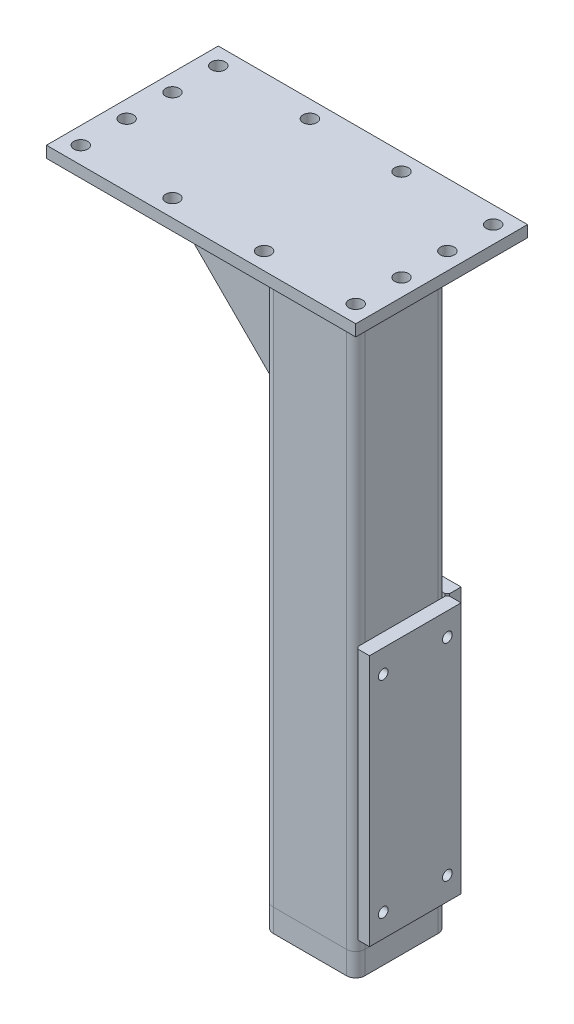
ISO-10303-21;
HEADER;
FILE_DESCRIPTION(('STEP AP214'),'2;1');
FILE_NAME('part.step','',(''),(''),'','','');
FILE_SCHEMA(('AUTOMOTIVE_DESIGN { 1 0 10303 214 1 1 1 1 }'));
ENDSEC;
DATA;
#1=APPLICATION_CONTEXT('core data for automotive mechanical design processes');
#2=APPLICATION_PROTOCOL_DEFINITION('international standard','automotive_design',2000,#1);
#3=PRODUCT_CONTEXT('',#1,'mechanical');
#4=PRODUCT('Part','Part','',(#3));
#5=PRODUCT_RELATED_PRODUCT_CATEGORY('part','',(#4));
#6=PRODUCT_DEFINITION_FORMATION('','',#4);
#7=PRODUCT_DEFINITION_CONTEXT('part definition',#1,'design');
#8=PRODUCT_DEFINITION('design','',#6,#7);
#9=PRODUCT_DEFINITION_SHAPE('','',#8);
#10=(LENGTH_UNIT() NAMED_UNIT(*) SI_UNIT(.MILLI.,.METRE.));
#11=(NAMED_UNIT(*) PLANE_ANGLE_UNIT() SI_UNIT($,.RADIAN.));
#12=(NAMED_UNIT(*) SI_UNIT($,.STERADIAN.) SOLID_ANGLE_UNIT());
#13=UNCERTAINTY_MEASURE_WITH_UNIT(LENGTH_MEASURE(1.E-05),#10,'distance_accuracy_value','');
#14=(GEOMETRIC_REPRESENTATION_CONTEXT(3) GLOBAL_UNCERTAINTY_ASSIGNED_CONTEXT((#13)) GLOBAL_UNIT_ASSIGNED_CONTEXT((#10,
#11,#12)) REPRESENTATION_CONTEXT('',''));
#15=CARTESIAN_POINT('',(0.,0.,0.));
#16=DIRECTION('',(0.,0.,1.));
#17=DIRECTION('',(1.,0.,0.));
#18=AXIS2_PLACEMENT_3D('',#15,#16,#17);
#19=CARTESIAN_POINT('',(-60.,-9.99999999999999,3.));
#20=DIRECTION('',(0.,-1.,0.));
#21=DIRECTION('',(0.,0.,-1.));
#22=AXIS2_PLACEMENT_3D('',#19,#20,#21);
#23=PLANE('',#22);
#24=DIRECTION('',(-1.,0.,0.));
#25=VECTOR('',#24,1.);
#26=CARTESIAN_POINT('',(-60.,-9.99999999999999,-3.));
#27=LINE('',#26,#25);
#28=CARTESIAN_POINT('',(-60.,-9.99999999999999,-3.));
#29=VERTEX_POINT('',#28);
#30=CARTESIAN_POINT('',(-190.,-9.99999999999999,-3.));
#31=VERTEX_POINT('',#30);
#32=EDGE_CURVE('E169',#29,#31,#27,.T.);
#33=ORIENTED_EDGE('',*,*,#32,.T.);
#34=DIRECTION('',(0.,0.,-1.));
#35=VECTOR('',#34,1.);
#36=CARTESIAN_POINT('',(-190.,-9.99999999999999,3.));
#37=LINE('',#36,#35);
#38=CARTESIAN_POINT('',(-190.,-9.99999999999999,3.));
#39=VERTEX_POINT('',#38);
#40=EDGE_CURVE('E13',#39,#31,#37,.T.);
#41=ORIENTED_EDGE('',*,*,#40,.F.);
#42=DIRECTION('',(-1.,0.,0.));
#43=VECTOR('',#42,1.);
#44=CARTESIAN_POINT('',(-60.,-9.99999999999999,3.));
#45=LINE('',#44,#43);
#46=CARTESIAN_POINT('',(-60.,-9.99999999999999,3.));
#47=VERTEX_POINT('',#46);
#48=EDGE_CURVE('E179',#47,#39,#45,.T.);
#49=ORIENTED_EDGE('',*,*,#48,.F.);
#50=DIRECTION('',(0.,0.,-1.));
#51=VECTOR('',#50,1.);
#52=CARTESIAN_POINT('',(-60.,-9.99999999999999,3.));
#53=LINE('',#52,#51);
#54=EDGE_CURVE('E165',#47,#29,#53,.T.);
#55=ORIENTED_EDGE('',*,*,#54,.T.);
#56=EDGE_LOOP('',(#33,#41,#49,#55));
#57=FACE_BOUND('',#56,.T.);
#58=ADVANCED_FACE('F85',(#57),#23,.F.);
#59=CARTESIAN_POINT('',(-190.,-9.99999999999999,3.));
#60=DIRECTION('',(1.,0.,0.));
#61=DIRECTION('',(0.,0.,-1.));
#62=AXIS2_PLACEMENT_3D('',#59,#60,#61);
#63=PLANE('',#62);
#64=DIRECTION('',(0.,-1.,0.));
#65=VECTOR('',#64,1.);
#66=CARTESIAN_POINT('',(-190.,-9.99999999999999,-3.));
#67=LINE('',#66,#65);
#68=CARTESIAN_POINT('',(-190.,-30.0000000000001,-3.));
#69=VERTEX_POINT('',#68);
#70=EDGE_CURVE('E172',#31,#69,#67,.T.);
#71=ORIENTED_EDGE('',*,*,#70,.T.);
#72=DIRECTION('',(0.,0.,-1.));
#73=VECTOR('',#72,1.);
#74=CARTESIAN_POINT('',(-190.,-30.0000000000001,3.));
#75=LINE('',#74,#73);
#76=CARTESIAN_POINT('',(-190.,-30.0000000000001,3.));
#77=VERTEX_POINT('',#76);
#78=EDGE_CURVE('E93',#77,#69,#75,.T.);
#79=ORIENTED_EDGE('',*,*,#78,.F.);
#80=DIRECTION('',(0.,-1.,0.));
#81=VECTOR('',#80,1.);
#82=CARTESIAN_POINT('',(-190.,-9.99999999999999,3.));
#83=LINE('',#82,#81);
#84=EDGE_CURVE('E138',#39,#77,#83,.T.);
#85=ORIENTED_EDGE('',*,*,#84,.F.);
#86=ORIENTED_EDGE('',*,*,#40,.T.);
#87=EDGE_LOOP('',(#71,#79,#85,#86));
#88=FACE_BOUND('',#87,.T.);
#89=ADVANCED_FACE('F203',(#88),#63,.F.);
#90=CARTESIAN_POINT('',(-190.,-30.0000000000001,3.));
#91=DIRECTION('',(0.707106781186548,0.707106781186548,0.));
#92=DIRECTION('',(-0.707106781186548,0.707106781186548,0.));
#93=AXIS2_PLACEMENT_3D('',#90,#91,#92);
#94=PLANE('',#93);
#95=DIRECTION('',(0.707106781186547,-0.707106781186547,0.));
#96=VECTOR('',#95,1.);
#97=CARTESIAN_POINT('',(-190.,-30.0000000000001,-3.));
#98=LINE('',#97,#96);
#99=CARTESIAN_POINT('',(-60.,-160.,-3.));
#100=VERTEX_POINT('',#99);
#101=EDGE_CURVE('E174',#69,#100,#98,.T.);
#102=ORIENTED_EDGE('',*,*,#101,.T.);
#103=DIRECTION('',(0.,0.,-1.));
#104=VECTOR('',#103,1.);
#105=CARTESIAN_POINT('',(-60.,-160.,3.));
#106=LINE('',#105,#104);
#107=CARTESIAN_POINT('',(-60.,-160.,3.));
#108=VERTEX_POINT('',#107);
#109=EDGE_CURVE('E160',#108,#100,#106,.T.);
#110=ORIENTED_EDGE('',*,*,#109,.F.);
#111=DIRECTION('',(0.707106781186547,-0.707106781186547,0.));
#112=VECTOR('',#111,1.);
#113=CARTESIAN_POINT('',(-190.,-30.0000000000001,3.));
#114=LINE('',#113,#112);
#115=EDGE_CURVE('E151',#77,#108,#114,.T.);
#116=ORIENTED_EDGE('',*,*,#115,.F.);
#117=ORIENTED_EDGE('',*,*,#78,.T.);
#118=EDGE_LOOP('',(#102,#110,#116,#117));
#119=FACE_BOUND('',#118,.T.);
#120=ADVANCED_FACE('F185',(#119),#94,.F.);
#121=CARTESIAN_POINT('',(-60.,-160.,3.));
#122=DIRECTION('',(0.,1.,0.));
#123=DIRECTION('',(0.,0.,1.));
#124=AXIS2_PLACEMENT_3D('',#121,#122,#123);
#125=PLANE('',#124);
#126=DIRECTION('',(1.,0.,0.));
#127=VECTOR('',#126,1.);
#128=CARTESIAN_POINT('',(-60.,-160.,-3.));
#129=LINE('',#128,#127);
#130=CARTESIAN_POINT('',(-39.9999999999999,-160.,-3.));
#131=VERTEX_POINT('',#130);
#132=EDGE_CURVE('E159',#100,#131,#129,.T.);
#133=ORIENTED_EDGE('',*,*,#132,.T.);
#134=DIRECTION('',(0.,0.,-1.));
#135=VECTOR('',#134,1.);
#136=CARTESIAN_POINT('',(-39.9999999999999,-160.,3.));
#137=LINE('',#136,#135);
#138=CARTESIAN_POINT('',(-39.9999999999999,-160.,3.));
#139=VERTEX_POINT('',#138);
#140=EDGE_CURVE('E156',#139,#131,#137,.T.);
#141=ORIENTED_EDGE('',*,*,#140,.F.);
#142=DIRECTION('',(1.,0.,0.));
#143=VECTOR('',#142,1.);
#144=CARTESIAN_POINT('',(-60.,-160.,3.));
#145=LINE('',#144,#143);
#146=EDGE_CURVE('E145',#108,#139,#145,.T.);
#147=ORIENTED_EDGE('',*,*,#146,.F.);
#148=ORIENTED_EDGE('',*,*,#109,.T.);
#149=EDGE_LOOP('',(#133,#141,#147,#148));
#150=FACE_BOUND('',#149,.T.);
#151=ADVANCED_FACE('F157',(#150),#125,.F.);
#152=CARTESIAN_POINT('',(-39.9999999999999,-160.,3.));
#153=DIRECTION('',(-1.,0.,0.));
#154=DIRECTION('',(0.,0.,1.));
#155=AXIS2_PLACEMENT_3D('',#152,#153,#154);
#156=PLANE('',#155);
#157=DIRECTION('',(0.,1.,0.));
#158=VECTOR('',#157,1.);
#159=CARTESIAN_POINT('',(-39.9999999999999,-160.,-3.));
#160=LINE('',#159,#158);
#161=CARTESIAN_POINT('',(-39.9999999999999,-30.0000000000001,-3.));
#162=VERTEX_POINT('',#161);
#163=EDGE_CURVE('E124',#131,#162,#160,.T.);
#164=ORIENTED_EDGE('',*,*,#163,.T.);
#165=DIRECTION('',(0.,0.,-1.));
#166=VECTOR('',#165,1.);
#167=CARTESIAN_POINT('',(-39.9999999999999,-30.0000000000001,3.));
#168=LINE('',#167,#166);
#169=CARTESIAN_POINT('',(-39.9999999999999,-30.0000000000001,3.));
#170=VERTEX_POINT('',#169);
#171=EDGE_CURVE('E161',#170,#162,#168,.T.);
#172=ORIENTED_EDGE('',*,*,#171,.F.);
#173=DIRECTION('',(0.,1.,0.));
#174=VECTOR('',#173,1.);
#175=CARTESIAN_POINT('',(-39.9999999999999,-160.,3.));
#176=LINE('',#175,#174);
#177=EDGE_CURVE('E149',#139,#170,#176,.T.);
#178=ORIENTED_EDGE('',*,*,#177,.F.);
#179=ORIENTED_EDGE('',*,*,#140,.T.);
#180=EDGE_LOOP('',(#164,#172,#178,#179));
#181=FACE_BOUND('',#180,.T.);
#182=ADVANCED_FACE('F163',(#181),#156,.F.);
#183=CARTESIAN_POINT('',(-39.9999999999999,-30.0000000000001,3.));
#184=DIRECTION('',(-0.707106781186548,-0.707106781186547,0.));
#185=DIRECTION('',(0.707106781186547,-0.707106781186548,0.));
#186=AXIS2_PLACEMENT_3D('',#183,#184,#185);
#187=PLANE('',#186);
#188=DIRECTION('',(-0.707106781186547,0.707106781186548,0.));
#189=VECTOR('',#188,1.);
#190=CARTESIAN_POINT('',(-39.9999999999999,-30.0000000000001,-3.));
#191=LINE('',#190,#189);
#192=EDGE_CURVE('E130',#162,#29,#191,.T.);
#193=ORIENTED_EDGE('',*,*,#192,.T.);
#194=ORIENTED_EDGE('',*,*,#54,.F.);
#195=DIRECTION('',(-0.707106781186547,0.707106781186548,0.));
#196=VECTOR('',#195,1.);
#197=CARTESIAN_POINT('',(-39.9999999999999,-30.0000000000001,3.));
#198=LINE('',#197,#196);
#199=EDGE_CURVE('E101',#170,#47,#198,.T.);
#200=ORIENTED_EDGE('',*,*,#199,.F.);
#201=ORIENTED_EDGE('',*,*,#171,.T.);
#202=EDGE_LOOP('',(#193,#194,#200,#201));
#203=FACE_BOUND('',#202,.T.);
#204=ADVANCED_FACE('F192',(#203),#187,.F.);
#205=CARTESIAN_POINT('',(0.,0.,3.));
#206=DIRECTION('',(0.,0.,1.));
#207=DIRECTION('',(1.,0.,0.));
#208=AXIS2_PLACEMENT_3D('',#205,#206,#207);
#209=PLANE('',#208);
#210=ORIENTED_EDGE('',*,*,#48,.T.);
#211=ORIENTED_EDGE('',*,*,#84,.T.);
#212=ORIENTED_EDGE('',*,*,#115,.T.);
#213=ORIENTED_EDGE('',*,*,#146,.T.);
#214=ORIENTED_EDGE('',*,*,#177,.T.);
#215=ORIENTED_EDGE('',*,*,#199,.T.);
#216=EDGE_LOOP('',(#210,#211,#212,#213,#214,#215));
#217=FACE_BOUND('',#216,.T.);
#218=ADVANCED_FACE('F147',(#217),#209,.T.);
#219=CARTESIAN_POINT('',(0.,0.,-3.));
#220=DIRECTION('',(0.,0.,1.));
#221=DIRECTION('',(1.,0.,0.));
#222=AXIS2_PLACEMENT_3D('',#219,#220,#221);
#223=PLANE('',#222);
#224=ORIENTED_EDGE('',*,*,#32,.F.);
#225=ORIENTED_EDGE('',*,*,#192,.F.);
#226=ORIENTED_EDGE('',*,*,#163,.F.);
#227=ORIENTED_EDGE('',*,*,#132,.F.);
#228=ORIENTED_EDGE('',*,*,#101,.F.);
#229=ORIENTED_EDGE('',*,*,#70,.F.);
#230=EDGE_LOOP('',(#224,#225,#226,#227,#228,#229));
#231=FACE_BOUND('',#230,.T.);
#232=ADVANCED_FACE('F188',(#231),#223,.F.);
#233=CLOSED_SHELL('',(#58,#89,#120,#151,#182,#204,#218,#232));
#234=MANIFOLD_SOLID_BREP('B2',#233);
#235=CARTESIAN_POINT('',(40.0000000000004,-280.,-51.9999999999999));
#236=DIRECTION('',(-1.,0.,0.));
#237=DIRECTION('',(0.,0.,1.));
#238=AXIS2_PLACEMENT_3D('',#235,#236,#237);
#239=PLANE('',#238);
#240=DIRECTION('',(0.,0.,1.));
#241=VECTOR('',#240,1.);
#242=CARTESIAN_POINT('',(40.0000000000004,-280.,-51.9999999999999));
#243=LINE('',#242,#241);
#244=CARTESIAN_POINT('',(40.0000000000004,-280.,-51.9999999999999));
#245=VERTEX_POINT('',#244);
#246=CARTESIAN_POINT('',(40.0000000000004,-280.,-41.9999999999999));
#247=VERTEX_POINT('',#246);
#248=EDGE_CURVE('E358',#245,#247,#243,.T.);
#249=ORIENTED_EDGE('',*,*,#248,.T.);
#250=DIRECTION('',(0.,-1.,0.));
#251=VECTOR('',#250,1.);
#252=CARTESIAN_POINT('',(40.0000000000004,-280.,-41.9999999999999));
#253=LINE('',#252,#251);
#254=CARTESIAN_POINT('',(40.0000000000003,-500.,-41.9999999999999));
#255=VERTEX_POINT('',#254);
#256=EDGE_CURVE('E332',#247,#255,#253,.T.);
#257=ORIENTED_EDGE('',*,*,#256,.T.);
#258=DIRECTION('',(0.,0.,1.));
#259=VECTOR('',#258,1.);
#260=CARTESIAN_POINT('',(40.0000000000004,-500.,-51.9999999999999));
#261=LINE('',#260,#259);
#262=CARTESIAN_POINT('',(40.0000000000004,-500.,-51.9999999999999));
#263=VERTEX_POINT('',#262);
#264=EDGE_CURVE('E313',#263,#255,#261,.T.);
#265=ORIENTED_EDGE('',*,*,#264,.F.);
#266=DIRECTION('',(0.,-1.,0.));
#267=VECTOR('',#266,1.);
#268=CARTESIAN_POINT('',(40.0000000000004,-280.,-51.9999999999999));
#269=LINE('',#268,#267);
#270=EDGE_CURVE('E319',#245,#263,#269,.T.);
#271=ORIENTED_EDGE('',*,*,#270,.F.);
#272=EDGE_LOOP('',(#249,#257,#265,#271));
#273=FACE_BOUND('',#272,.T.);
#274=ADVANCED_FACE('F254',(#273),#239,.F.);
#275=CARTESIAN_POINT('',(40.0000000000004,-500.,-51.9999999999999));
#276=DIRECTION('',(0.,1.,0.));
#277=DIRECTION('',(1.,0.,0.));
#278=AXIS2_PLACEMENT_3D('',#275,#276,#277);
#279=PLANE('',#278);
#280=ORIENTED_EDGE('',*,*,#264,.T.);
#281=DIRECTION('',(0.70710678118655,0.,-0.707106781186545));
#282=VECTOR('',#281,1.);
#283=CARTESIAN_POINT('',(40.0000000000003,-500.,-41.9999999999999));
#284=LINE('',#283,#282);
#285=CARTESIAN_POINT('',(38.0000000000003,-500.,-39.9999999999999));
#286=VERTEX_POINT('',#285);
#287=EDGE_CURVE('E350',#255,#286,#284,.F.);
#288=ORIENTED_EDGE('',*,*,#287,.T.);
#289=DIRECTION('',(-1.,0.,0.));
#290=VECTOR('',#289,1.);
#291=CARTESIAN_POINT('',(40.0000000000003,-500.,-39.9999999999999));
#292=LINE('',#291,#290);
#293=CARTESIAN_POINT('',(-37.9999999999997,-500.,-40.0000000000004));
#294=VERTEX_POINT('',#293);
#295=EDGE_CURVE('E363',#286,#294,#292,.T.);
#296=ORIENTED_EDGE('',*,*,#295,.T.);
#297=DIRECTION('',(0.707106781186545,0.,0.70710678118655));
#298=VECTOR('',#297,1.);
#299=CARTESIAN_POINT('',(-39.9999999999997,-500.,-42.0000000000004));
#300=LINE('',#299,#298);
#301=CARTESIAN_POINT('',(-39.9999999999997,-500.,-42.0000000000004));
#302=VERTEX_POINT('',#301);
#303=EDGE_CURVE('E334',#294,#302,#300,.F.);
#304=ORIENTED_EDGE('',*,*,#303,.T.);
#305=DIRECTION('',(0.,0.,1.));
#306=VECTOR('',#305,1.);
#307=CARTESIAN_POINT('',(-39.9999999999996,-500.,-52.0000000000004));
#308=LINE('',#307,#306);
#309=CARTESIAN_POINT('',(-39.9999999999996,-500.,-52.0000000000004));
#310=VERTEX_POINT('',#309);
#311=EDGE_CURVE('E315',#310,#302,#308,.T.);
#312=ORIENTED_EDGE('',*,*,#311,.F.);
#313=DIRECTION('',(-1.,0.,0.));
#314=VECTOR('',#313,1.);
#315=CARTESIAN_POINT('',(40.0000000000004,-500.,-51.9999999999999));
#316=LINE('',#315,#314);
#317=EDGE_CURVE('E309',#263,#310,#316,.T.);
#318=ORIENTED_EDGE('',*,*,#317,.F.);
#319=EDGE_LOOP('',(#280,#288,#296,#304,#312,#318));
#320=FACE_BOUND('',#319,.T.);
#321=ADVANCED_FACE('F311',(#320),#279,.F.);
#322=CARTESIAN_POINT('',(-39.9999999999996,-280.,-52.0000000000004));
#323=DIRECTION('',(1.,0.,0.));
#324=DIRECTION('',(0.,0.,-1.));
#325=AXIS2_PLACEMENT_3D('',#322,#323,#324);
#326=PLANE('',#325);
#327=ORIENTED_EDGE('',*,*,#311,.T.);
#328=DIRECTION('',(0.,1.,0.));
#329=VECTOR('',#328,1.);
#330=CARTESIAN_POINT('',(-39.9999999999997,-280.,-42.0000000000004));
#331=LINE('',#330,#329);
#332=CARTESIAN_POINT('',(-39.9999999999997,-280.,-42.0000000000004));
#333=VERTEX_POINT('',#332);
#334=EDGE_CURVE('E83',#302,#333,#331,.T.);
#335=ORIENTED_EDGE('',*,*,#334,.T.);
#336=DIRECTION('',(0.,0.,1.));
#337=VECTOR('',#336,1.);
#338=CARTESIAN_POINT('',(-39.9999999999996,-280.,-52.0000000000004));
#339=LINE('',#338,#337);
#340=CARTESIAN_POINT('',(-39.9999999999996,-280.,-52.0000000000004));
#341=VERTEX_POINT('',#340);
#342=EDGE_CURVE('E336',#341,#333,#339,.T.);
#343=ORIENTED_EDGE('',*,*,#342,.F.);
#344=DIRECTION('',(0.,1.,0.));
#345=VECTOR('',#344,1.);
#346=CARTESIAN_POINT('',(-39.9999999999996,-280.,-52.0000000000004));
#347=LINE('',#346,#345);
#348=EDGE_CURVE('E318',#310,#341,#347,.T.);
#349=ORIENTED_EDGE('',*,*,#348,.F.);
#350=EDGE_LOOP('',(#327,#335,#343,#349));
#351=FACE_BOUND('',#350,.T.);
#352=ADVANCED_FACE('F377',(#351),#326,.F.);
#353=CARTESIAN_POINT('',(40.0000000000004,-280.,-51.9999999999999));
#354=DIRECTION('',(0.,-1.,0.));
#355=DIRECTION('',(-1.,0.,0.));
#356=AXIS2_PLACEMENT_3D('',#353,#354,#355);
#357=PLANE('',#356);
#358=DIRECTION('',(1.,0.,0.));
#359=VECTOR('',#358,1.);
#360=CARTESIAN_POINT('',(40.0000000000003,-280.,-39.9999999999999));
#361=LINE('',#360,#359);
#362=CARTESIAN_POINT('',(-37.9999999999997,-280.,-40.0000000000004));
#363=VERTEX_POINT('',#362);
#364=CARTESIAN_POINT('',(38.0000000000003,-280.,-39.9999999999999));
#365=VERTEX_POINT('',#364);
#366=EDGE_CURVE('E328',#363,#365,#361,.T.);
#367=ORIENTED_EDGE('',*,*,#366,.T.);
#368=DIRECTION('',(-0.70710678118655,0.,0.707106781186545));
#369=VECTOR('',#368,1.);
#370=CARTESIAN_POINT('',(40.0000000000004,-280.,-41.9999999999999));
#371=LINE('',#370,#369);
#372=EDGE_CURVE('E262',#365,#247,#371,.F.);
#373=ORIENTED_EDGE('',*,*,#372,.T.);
#374=ORIENTED_EDGE('',*,*,#248,.F.);
#375=DIRECTION('',(1.,0.,0.));
#376=VECTOR('',#375,1.);
#377=CARTESIAN_POINT('',(40.0000000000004,-280.,-51.9999999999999));
#378=LINE('',#377,#376);
#379=EDGE_CURVE('E324',#341,#245,#378,.T.);
#380=ORIENTED_EDGE('',*,*,#379,.F.);
#381=ORIENTED_EDGE('',*,*,#342,.T.);
#382=DIRECTION('',(-0.707106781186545,0.,-0.70710678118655));
#383=VECTOR('',#382,1.);
#384=CARTESIAN_POINT('',(-39.9999999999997,-280.,-42.0000000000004));
#385=LINE('',#384,#383);
#386=EDGE_CURVE('E269',#333,#363,#385,.F.);
#387=ORIENTED_EDGE('',*,*,#386,.T.);
#388=EDGE_LOOP('',(#367,#373,#374,#380,#381,#387));
#389=FACE_BOUND('',#388,.T.);
#390=ADVANCED_FACE('F357',(#389),#357,.F.);
#391=CARTESIAN_POINT('',(3.63114059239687E-13,0.,-52.0000000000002));
#392=DIRECTION('',(0.,0.,-1.));
#393=DIRECTION('',(-1.,0.,0.));
#394=AXIS2_PLACEMENT_3D('',#391,#392,#393);
#395=PLANE('',#394);
#396=CARTESIAN_POINT('',(28.,-480.,-52.0000000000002));
#397=DIRECTION('',(0.,0.,-1.));
#398=DIRECTION('',(-1.,0.,0.));
#399=AXIS2_PLACEMENT_3D('',#396,#397,#398);
#400=CIRCLE('',#399,4.24999999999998);
#401=CARTESIAN_POINT('',(23.75,-480.,-52.0000000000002));
#402=VERTEX_POINT('',#401);
#403=EDGE_CURVE('E347',#402,#402,#400,.T.);
#404=ORIENTED_EDGE('',*,*,#403,.F.);
#405=EDGE_LOOP('',(#404));
#406=FACE_BOUND('',#405,.T.);
#407=CARTESIAN_POINT('',(28.,-300.,-52.0000000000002));
#408=DIRECTION('',(0.,0.,-1.));
#409=DIRECTION('',(-1.,0.,0.));
#410=AXIS2_PLACEMENT_3D('',#407,#408,#409);
#411=CIRCLE('',#410,4.24999999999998);
#412=CARTESIAN_POINT('',(23.75,-300.,-52.0000000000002));
#413=VERTEX_POINT('',#412);
#414=EDGE_CURVE('E344',#413,#413,#411,.T.);
#415=ORIENTED_EDGE('',*,*,#414,.F.);
#416=EDGE_LOOP('',(#415));
#417=FACE_BOUND('',#416,.T.);
#418=CARTESIAN_POINT('',(-28.,-480.,-52.0000000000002));
#419=DIRECTION('',(0.,0.,-1.));
#420=DIRECTION('',(-1.,0.,0.));
#421=AXIS2_PLACEMENT_3D('',#418,#419,#420);
#422=CIRCLE('',#421,4.24999999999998);
#423=CARTESIAN_POINT('',(-32.2499999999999,-480.,-52.0000000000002));
#424=VERTEX_POINT('',#423);
#425=EDGE_CURVE('E343',#424,#424,#422,.T.);
#426=ORIENTED_EDGE('',*,*,#425,.F.);
#427=EDGE_LOOP('',(#426));
#428=FACE_BOUND('',#427,.T.);
#429=CARTESIAN_POINT('',(-28.,-300.,-52.0000000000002));
#430=DIRECTION('',(0.,0.,-1.));
#431=DIRECTION('',(-1.,0.,0.));
#432=AXIS2_PLACEMENT_3D('',#429,#430,#431);
#433=CIRCLE('',#432,4.24999999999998);
#434=CARTESIAN_POINT('',(-32.25,-300.,-52.0000000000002));
#435=VERTEX_POINT('',#434);
#436=EDGE_CURVE('E370',#435,#435,#433,.T.);
#437=ORIENTED_EDGE('',*,*,#436,.F.);
#438=EDGE_LOOP('',(#437));
#439=FACE_BOUND('',#438,.T.);
#440=ORIENTED_EDGE('',*,*,#270,.T.);
#441=ORIENTED_EDGE('',*,*,#317,.T.);
#442=ORIENTED_EDGE('',*,*,#348,.T.);
#443=ORIENTED_EDGE('',*,*,#379,.T.);
#444=EDGE_LOOP('',(#440,#441,#442,#443));
#445=FACE_BOUND('',#444,.T.);
#446=ADVANCED_FACE('F322',(#406,#417,#428,#439,#445),#395,.T.);
#447=CARTESIAN_POINT('',(2.79318507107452E-13,0.,-40.0000000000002));
#448=DIRECTION('',(0.,0.,-1.));
#449=DIRECTION('',(-1.,0.,0.));
#450=AXIS2_PLACEMENT_3D('',#447,#448,#449);
#451=PLANE('',#450);
#452=CARTESIAN_POINT('',(28.,-480.,-40.));
#453=DIRECTION('',(0.,0.,-1.));
#454=DIRECTION('',(-1.,0.,0.));
#455=AXIS2_PLACEMENT_3D('',#452,#453,#454);
#456=CIRCLE('',#455,4.24999999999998);
#457=CARTESIAN_POINT('',(23.75,-480.,-40.));
#458=VERTEX_POINT('',#457);
#459=EDGE_CURVE('E345',#458,#458,#456,.T.);
#460=ORIENTED_EDGE('',*,*,#459,.T.);
#461=EDGE_LOOP('',(#460));
#462=FACE_BOUND('',#461,.T.);
#463=CARTESIAN_POINT('',(28.,-300.,-40.));
#464=DIRECTION('',(0.,0.,-1.));
#465=DIRECTION('',(-1.,0.,0.));
#466=AXIS2_PLACEMENT_3D('',#463,#464,#465);
#467=CIRCLE('',#466,4.24999999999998);
#468=CARTESIAN_POINT('',(23.75,-300.,-40.));
#469=VERTEX_POINT('',#468);
#470=EDGE_CURVE('E340',#469,#469,#467,.T.);
#471=ORIENTED_EDGE('',*,*,#470,.T.);
#472=EDGE_LOOP('',(#471));
#473=FACE_BOUND('',#472,.T.);
#474=CARTESIAN_POINT('',(-28.,-480.,-40.0000000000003));
#475=DIRECTION('',(0.,0.,-1.));
#476=DIRECTION('',(-1.,0.,0.));
#477=AXIS2_PLACEMENT_3D('',#474,#475,#476);
#478=CIRCLE('',#477,4.24999999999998);
#479=CARTESIAN_POINT('',(-32.2499999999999,-480.,-40.0000000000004));
#480=VERTEX_POINT('',#479);
#481=EDGE_CURVE('E426',#480,#480,#478,.T.);
#482=ORIENTED_EDGE('',*,*,#481,.T.);
#483=EDGE_LOOP('',(#482));
#484=FACE_BOUND('',#483,.T.);
#485=CARTESIAN_POINT('',(-28.,-300.,-40.0000000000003));
#486=DIRECTION('',(0.,0.,-1.));
#487=DIRECTION('',(-1.,0.,0.));
#488=AXIS2_PLACEMENT_3D('',#485,#486,#487);
#489=CIRCLE('',#488,4.24999999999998);
#490=CARTESIAN_POINT('',(-32.25,-300.,-40.0000000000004));
#491=VERTEX_POINT('',#490);
#492=EDGE_CURVE('E366',#491,#491,#489,.T.);
#493=ORIENTED_EDGE('',*,*,#492,.T.);
#494=EDGE_LOOP('',(#493));
#495=FACE_BOUND('',#494,.T.);
#496=ORIENTED_EDGE('',*,*,#295,.F.);
#497=DIRECTION('',(0.,1.,0.));
#498=VECTOR('',#497,1.);
#499=CARTESIAN_POINT('',(38.0000000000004,0.,-39.9999999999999));
#500=LINE('',#499,#498);
#501=EDGE_CURVE('E276',#286,#365,#500,.T.);
#502=ORIENTED_EDGE('',*,*,#501,.T.);
#503=ORIENTED_EDGE('',*,*,#366,.F.);
#504=DIRECTION('',(0.,-1.,0.));
#505=VECTOR('',#504,1.);
#506=CARTESIAN_POINT('',(-37.9999999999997,0.,-40.0000000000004));
#507=LINE('',#506,#505);
#508=EDGE_CURVE('E352',#363,#294,#507,.T.);
#509=ORIENTED_EDGE('',*,*,#508,.T.);
#510=EDGE_LOOP('',(#496,#502,#503,#509));
#511=FACE_BOUND('',#510,.T.);
#512=ADVANCED_FACE('F365',(#462,#473,#484,#495,#511),#451,.F.);
#513=CARTESIAN_POINT('',(-28.,-300.,-52.0000000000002));
#514=DIRECTION('',(0.,0.,-1.));
#515=DIRECTION('',(-1.,0.,0.));
#516=AXIS2_PLACEMENT_3D('',#513,#514,#515);
#517=CYLINDRICAL_SURFACE('',#516,4.24999999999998);
#518=ORIENTED_EDGE('',*,*,#436,.T.);
#519=EDGE_LOOP('',(#518));
#520=FACE_BOUND('',#519,.T.);
#521=ORIENTED_EDGE('',*,*,#492,.F.);
#522=EDGE_LOOP('',(#521));
#523=FACE_BOUND('',#522,.T.);
#524=ADVANCED_FACE('F396',(#520,#523),#517,.F.);
#525=CARTESIAN_POINT('',(-28.,-480.,-52.0000000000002));
#526=DIRECTION('',(0.,0.,-1.));
#527=DIRECTION('',(-1.,0.,0.));
#528=AXIS2_PLACEMENT_3D('',#525,#526,#527);
#529=CYLINDRICAL_SURFACE('',#528,4.24999999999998);
#530=ORIENTED_EDGE('',*,*,#425,.T.);
#531=EDGE_LOOP('',(#530));
#532=FACE_BOUND('',#531,.T.);
#533=ORIENTED_EDGE('',*,*,#481,.F.);
#534=EDGE_LOOP('',(#533));
#535=FACE_BOUND('',#534,.T.);
#536=ADVANCED_FACE('F403',(#532,#535),#529,.F.);
#537=CARTESIAN_POINT('',(28.,-300.,-52.0000000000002));
#538=DIRECTION('',(0.,0.,-1.));
#539=DIRECTION('',(-1.,0.,0.));
#540=AXIS2_PLACEMENT_3D('',#537,#538,#539);
#541=CYLINDRICAL_SURFACE('',#540,4.24999999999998);
#542=ORIENTED_EDGE('',*,*,#414,.T.);
#543=EDGE_LOOP('',(#542));
#544=FACE_BOUND('',#543,.T.);
#545=ORIENTED_EDGE('',*,*,#470,.F.);
#546=EDGE_LOOP('',(#545));
#547=FACE_BOUND('',#546,.T.);
#548=ADVANCED_FACE('F407',(#544,#547),#541,.F.);
#549=CARTESIAN_POINT('',(28.,-480.,-52.0000000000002));
#550=DIRECTION('',(0.,0.,-1.));
#551=DIRECTION('',(-1.,0.,0.));
#552=AXIS2_PLACEMENT_3D('',#549,#550,#551);
#553=CYLINDRICAL_SURFACE('',#552,4.24999999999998);
#554=ORIENTED_EDGE('',*,*,#403,.T.);
#555=EDGE_LOOP('',(#554));
#556=FACE_BOUND('',#555,.T.);
#557=ORIENTED_EDGE('',*,*,#459,.F.);
#558=EDGE_LOOP('',(#557));
#559=FACE_BOUND('',#558,.T.);
#560=ADVANCED_FACE('F382',(#556,#559),#553,.F.);
#561=CARTESIAN_POINT('',(40.0000000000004,-280.,-41.9999999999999));
#562=DIRECTION('',(-0.707106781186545,0.,-0.70710678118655));
#563=DIRECTION('',(0.,-1.,0.));
#564=AXIS2_PLACEMENT_3D('',#561,#562,#563);
#565=PLANE('',#564);
#566=ORIENTED_EDGE('',*,*,#372,.F.);
#567=ORIENTED_EDGE('',*,*,#501,.F.);
#568=ORIENTED_EDGE('',*,*,#287,.F.);
#569=ORIENTED_EDGE('',*,*,#256,.F.);
#570=EDGE_LOOP('',(#566,#567,#568,#569));
#571=FACE_BOUND('',#570,.T.);
#572=ADVANCED_FACE('F361',(#571),#565,.F.);
#573=CARTESIAN_POINT('',(-39.9999999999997,-280.,-42.0000000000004));
#574=DIRECTION('',(0.70710678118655,0.,-0.707106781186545));
#575=DIRECTION('',(0.,1.,0.));
#576=AXIS2_PLACEMENT_3D('',#573,#574,#575);
#577=PLANE('',#576);
#578=ORIENTED_EDGE('',*,*,#303,.F.);
#579=ORIENTED_EDGE('',*,*,#508,.F.);
#580=ORIENTED_EDGE('',*,*,#386,.F.);
#581=ORIENTED_EDGE('',*,*,#334,.F.);
#582=EDGE_LOOP('',(#578,#579,#580,#581));
#583=FACE_BOUND('',#582,.T.);
#584=ADVANCED_FACE('F256',(#583),#577,.F.);
#585=CLOSED_SHELL('',(#274,#321,#352,#390,#446,#512,#524,#536,#548,#560,#572,#584));
#586=MANIFOLD_SOLID_BREP('B7',#585);
#587=CARTESIAN_POINT('',(51.9999999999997,-280.,40.0000000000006));
#588=DIRECTION('',(0.,0.,-1.));
#589=DIRECTION('',(-1.,0.,0.));
#590=AXIS2_PLACEMENT_3D('',#587,#588,#589);
#591=PLANE('',#590);
#592=DIRECTION('',(-1.,0.,0.));
#593=VECTOR('',#592,1.);
#594=CARTESIAN_POINT('',(51.9999999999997,-280.,40.0000000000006));
#595=LINE('',#594,#593);
#596=CARTESIAN_POINT('',(51.9999999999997,-280.,40.0000000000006));
#597=VERTEX_POINT('',#596);
#598=CARTESIAN_POINT('',(41.9999999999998,-280.,40.0000000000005));
#599=VERTEX_POINT('',#598);
#600=EDGE_CURVE('E637',#597,#599,#595,.T.);
#601=ORIENTED_EDGE('',*,*,#600,.T.);
#602=DIRECTION('',(0.,-1.,0.));
#603=VECTOR('',#602,1.);
#604=CARTESIAN_POINT('',(41.9999999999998,-280.,40.0000000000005));
#605=LINE('',#604,#603);
#606=CARTESIAN_POINT('',(41.9999999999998,-500.,40.0000000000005));
#607=VERTEX_POINT('',#606);
#608=EDGE_CURVE('E611',#599,#607,#605,.T.);
#609=ORIENTED_EDGE('',*,*,#608,.T.);
#610=DIRECTION('',(-1.,0.,0.));
#611=VECTOR('',#610,1.);
#612=CARTESIAN_POINT('',(51.9999999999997,-500.,40.0000000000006));
#613=LINE('',#612,#611);
#614=CARTESIAN_POINT('',(51.9999999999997,-500.,40.0000000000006));
#615=VERTEX_POINT('',#614);
#616=EDGE_CURVE('E592',#615,#607,#613,.T.);
#617=ORIENTED_EDGE('',*,*,#616,.F.);
#618=DIRECTION('',(0.,-1.,0.));
#619=VECTOR('',#618,1.);
#620=CARTESIAN_POINT('',(51.9999999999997,-280.,40.0000000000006));
#621=LINE('',#620,#619);
#622=EDGE_CURVE('E598',#597,#615,#621,.T.);
#623=ORIENTED_EDGE('',*,*,#622,.F.);
#624=EDGE_LOOP('',(#601,#609,#617,#623));
#625=FACE_BOUND('',#624,.T.);
#626=ADVANCED_FACE('F533',(#625),#591,.F.);
#627=CARTESIAN_POINT('',(51.9999999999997,-500.,40.0000000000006));
#628=DIRECTION('',(0.,1.,0.));
#629=DIRECTION('',(0.,0.,1.));
#630=AXIS2_PLACEMENT_3D('',#627,#628,#629);
#631=PLANE('',#630);
#632=ORIENTED_EDGE('',*,*,#616,.T.);
#633=DIRECTION('',(0.707106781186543,0.,0.707106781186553));
#634=VECTOR('',#633,1.);
#635=CARTESIAN_POINT('',(41.9999999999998,-500.,40.0000000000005));
#636=LINE('',#635,#634);
#637=CARTESIAN_POINT('',(39.9999999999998,-500.,38.0000000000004));
#638=VERTEX_POINT('',#637);
#639=EDGE_CURVE('E629',#607,#638,#636,.F.);
#640=ORIENTED_EDGE('',*,*,#639,.T.);
#641=DIRECTION('',(0.,0.,-1.));
#642=VECTOR('',#641,1.);
#643=CARTESIAN_POINT('',(39.9999999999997,-500.,40.0000000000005));
#644=LINE('',#643,#642);
#645=CARTESIAN_POINT('',(40.0000000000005,-500.,-37.9999999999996));
#646=VERTEX_POINT('',#645);
#647=EDGE_CURVE('E642',#638,#646,#644,.T.);
#648=ORIENTED_EDGE('',*,*,#647,.T.);
#649=DIRECTION('',(-0.707106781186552,0.,0.707106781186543));
#650=VECTOR('',#649,1.);
#651=CARTESIAN_POINT('',(42.0000000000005,-500.,-39.9999999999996));
#652=LINE('',#651,#650);
#653=CARTESIAN_POINT('',(42.0000000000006,-500.,-39.9999999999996));
#654=VERTEX_POINT('',#653);
#655=EDGE_CURVE('E613',#646,#654,#652,.F.);
#656=ORIENTED_EDGE('',*,*,#655,.T.);
#657=DIRECTION('',(-1.,0.,0.));
#658=VECTOR('',#657,1.);
#659=CARTESIAN_POINT('',(52.0000000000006,-500.,-39.9999999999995));
#660=LINE('',#659,#658);
#661=CARTESIAN_POINT('',(52.0000000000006,-500.,-39.9999999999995));
#662=VERTEX_POINT('',#661);
#663=EDGE_CURVE('E594',#662,#654,#660,.T.);
#664=ORIENTED_EDGE('',*,*,#663,.F.);
#665=DIRECTION('',(0.,0.,-1.));
#666=VECTOR('',#665,1.);
#667=CARTESIAN_POINT('',(51.9999999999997,-500.,40.0000000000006));
#668=LINE('',#667,#666);
#669=EDGE_CURVE('E588',#615,#662,#668,.T.);
#670=ORIENTED_EDGE('',*,*,#669,.F.);
#671=EDGE_LOOP('',(#632,#640,#648,#656,#664,#670));
#672=FACE_BOUND('',#671,.T.);
#673=ADVANCED_FACE('F590',(#672),#631,.F.);
#674=CARTESIAN_POINT('',(52.0000000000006,-280.,-39.9999999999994));
#675=DIRECTION('',(0.,0.,1.));
#676=DIRECTION('',(1.,0.,0.));
#677=AXIS2_PLACEMENT_3D('',#674,#675,#676);
#678=PLANE('',#677);
#679=ORIENTED_EDGE('',*,*,#663,.T.);
#680=DIRECTION('',(0.,1.,0.));
#681=VECTOR('',#680,1.);
#682=CARTESIAN_POINT('',(42.0000000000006,-280.,-39.9999999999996));
#683=LINE('',#682,#681);
#684=CARTESIAN_POINT('',(42.0000000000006,-280.,-39.9999999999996));
#685=VERTEX_POINT('',#684);
#686=EDGE_CURVE('E252',#654,#685,#683,.T.);
#687=ORIENTED_EDGE('',*,*,#686,.T.);
#688=DIRECTION('',(-1.,0.,0.));
#689=VECTOR('',#688,1.);
#690=CARTESIAN_POINT('',(52.0000000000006,-280.,-39.9999999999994));
#691=LINE('',#690,#689);
#692=CARTESIAN_POINT('',(52.0000000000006,-280.,-39.9999999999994));
#693=VERTEX_POINT('',#692);
#694=EDGE_CURVE('E615',#693,#685,#691,.T.);
#695=ORIENTED_EDGE('',*,*,#694,.F.);
#696=DIRECTION('',(0.,1.,0.));
#697=VECTOR('',#696,1.);
#698=CARTESIAN_POINT('',(52.0000000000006,-280.,-39.9999999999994));
#699=LINE('',#698,#697);
#700=EDGE_CURVE('E597',#662,#693,#699,.T.);
#701=ORIENTED_EDGE('',*,*,#700,.F.);
#702=EDGE_LOOP('',(#679,#687,#695,#701));
#703=FACE_BOUND('',#702,.T.);
#704=ADVANCED_FACE('F656',(#703),#678,.F.);
#705=CARTESIAN_POINT('',(51.9999999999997,-280.,40.0000000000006));
#706=DIRECTION('',(0.,-1.,0.));
#707=DIRECTION('',(0.,0.,-1.));
#708=AXIS2_PLACEMENT_3D('',#705,#706,#707);
#709=PLANE('',#708);
#710=DIRECTION('',(0.,0.,1.));
#711=VECTOR('',#710,1.);
#712=CARTESIAN_POINT('',(39.9999999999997,-280.,40.0000000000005));
#713=LINE('',#712,#711);
#714=CARTESIAN_POINT('',(40.0000000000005,-280.,-37.9999999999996));
#715=VERTEX_POINT('',#714);
#716=CARTESIAN_POINT('',(39.9999999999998,-280.,38.0000000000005));
#717=VERTEX_POINT('',#716);
#718=EDGE_CURVE('E607',#715,#717,#713,.T.);
#719=ORIENTED_EDGE('',*,*,#718,.T.);
#720=DIRECTION('',(-0.707106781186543,0.,-0.707106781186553));
#721=VECTOR('',#720,1.);
#722=CARTESIAN_POINT('',(41.9999999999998,-280.,40.0000000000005));
#723=LINE('',#722,#721);
#724=EDGE_CURVE('E541',#717,#599,#723,.F.);
#725=ORIENTED_EDGE('',*,*,#724,.T.);
#726=ORIENTED_EDGE('',*,*,#600,.F.);
#727=DIRECTION('',(0.,0.,1.));
#728=VECTOR('',#727,1.);
#729=CARTESIAN_POINT('',(51.9999999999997,-280.,40.0000000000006));
#730=LINE('',#729,#728);
#731=EDGE_CURVE('E603',#693,#597,#730,.T.);
#732=ORIENTED_EDGE('',*,*,#731,.F.);
#733=ORIENTED_EDGE('',*,*,#694,.T.);
#734=DIRECTION('',(0.707106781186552,0.,-0.707106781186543));
#735=VECTOR('',#734,1.);
#736=CARTESIAN_POINT('',(42.0000000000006,-280.,-39.9999999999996));
#737=LINE('',#736,#735);
#738=EDGE_CURVE('E548',#685,#715,#737,.F.);
#739=ORIENTED_EDGE('',*,*,#738,.T.);
#740=EDGE_LOOP('',(#719,#725,#726,#732,#733,#739));
#741=FACE_BOUND('',#740,.T.);
#742=ADVANCED_FACE('F636',(#741),#709,.F.);
#743=CARTESIAN_POINT('',(52.0000000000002,0.,5.4467108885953E-13));
#744=DIRECTION('',(1.,0.,0.));
#745=DIRECTION('',(0.,0.,-1.));
#746=AXIS2_PLACEMENT_3D('',#743,#744,#745);
#747=PLANE('',#746);
#748=CARTESIAN_POINT('',(52.0000000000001,-480.,28.0000000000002));
#749=DIRECTION('',(1.,0.,0.));
#750=DIRECTION('',(0.,0.,-1.));
#751=AXIS2_PLACEMENT_3D('',#748,#749,#750);
#752=CIRCLE('',#751,4.24999999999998);
#753=CARTESIAN_POINT('',(52.0000000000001,-480.,23.7500000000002));
#754=VERTEX_POINT('',#753);
#755=EDGE_CURVE('E626',#754,#754,#752,.T.);
#756=ORIENTED_EDGE('',*,*,#755,.F.);
#757=EDGE_LOOP('',(#756));
#758=FACE_BOUND('',#757,.T.);
#759=CARTESIAN_POINT('',(52.0000000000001,-300.,28.0000000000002));
#760=DIRECTION('',(1.,0.,0.));
#761=DIRECTION('',(0.,0.,-1.));
#762=AXIS2_PLACEMENT_3D('',#759,#760,#761);
#763=CIRCLE('',#762,4.24999999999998);
#764=CARTESIAN_POINT('',(52.0000000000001,-300.,23.7500000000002));
#765=VERTEX_POINT('',#764);
#766=EDGE_CURVE('E623',#765,#765,#763,.T.);
#767=ORIENTED_EDGE('',*,*,#766,.F.);
#768=EDGE_LOOP('',(#767));
#769=FACE_BOUND('',#768,.T.);
#770=CARTESIAN_POINT('',(52.0000000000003,-480.,-27.9999999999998));
#771=DIRECTION('',(1.,0.,0.));
#772=DIRECTION('',(0.,0.,-1.));
#773=AXIS2_PLACEMENT_3D('',#770,#771,#772);
#774=CIRCLE('',#773,4.24999999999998);
#775=CARTESIAN_POINT('',(52.0000000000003,-480.,-32.2499999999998));
#776=VERTEX_POINT('',#775);
#777=EDGE_CURVE('E622',#776,#776,#774,.T.);
#778=ORIENTED_EDGE('',*,*,#777,.F.);
#779=EDGE_LOOP('',(#778));
#780=FACE_BOUND('',#779,.T.);
#781=CARTESIAN_POINT('',(52.0000000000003,-300.,-27.9999999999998));
#782=DIRECTION('',(1.,0.,0.));
#783=DIRECTION('',(0.,0.,-1.));
#784=AXIS2_PLACEMENT_3D('',#781,#782,#783);
#785=CIRCLE('',#784,4.24999999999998);
#786=CARTESIAN_POINT('',(52.0000000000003,-300.,-32.2499999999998));
#787=VERTEX_POINT('',#786);
#788=EDGE_CURVE('E649',#787,#787,#785,.T.);
#789=ORIENTED_EDGE('',*,*,#788,.F.);
#790=EDGE_LOOP('',(#789));
#791=FACE_BOUND('',#790,.T.);
#792=ORIENTED_EDGE('',*,*,#622,.T.);
#793=ORIENTED_EDGE('',*,*,#669,.T.);
#794=ORIENTED_EDGE('',*,*,#700,.T.);
#795=ORIENTED_EDGE('',*,*,#731,.T.);
#796=EDGE_LOOP('',(#792,#793,#794,#795));
#797=FACE_BOUND('',#796,.T.);
#798=ADVANCED_FACE('F601',(#758,#769,#780,#791,#797),#747,.T.);
#799=CARTESIAN_POINT('',(40.0000000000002,0.,4.18977760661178E-13));
#800=DIRECTION('',(1.,0.,0.));
#801=DIRECTION('',(0.,0.,-1.));
#802=AXIS2_PLACEMENT_3D('',#799,#800,#801);
#803=PLANE('',#802);
#804=CARTESIAN_POINT('',(39.9999999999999,-480.,28.0000000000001));
#805=DIRECTION('',(1.,0.,0.));
#806=DIRECTION('',(0.,0.,-1.));
#807=AXIS2_PLACEMENT_3D('',#804,#805,#806);
#808=CIRCLE('',#807,4.24999999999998);
#809=CARTESIAN_POINT('',(39.9999999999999,-480.,23.7500000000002));
#810=VERTEX_POINT('',#809);
#811=EDGE_CURVE('E624',#810,#810,#808,.T.);
#812=ORIENTED_EDGE('',*,*,#811,.T.);
#813=EDGE_LOOP('',(#812));
#814=FACE_BOUND('',#813,.T.);
#815=CARTESIAN_POINT('',(39.9999999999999,-300.,28.0000000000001));
#816=DIRECTION('',(1.,0.,0.));
#817=DIRECTION('',(0.,0.,-1.));
#818=AXIS2_PLACEMENT_3D('',#815,#816,#817);
#819=CIRCLE('',#818,4.24999999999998);
#820=CARTESIAN_POINT('',(39.9999999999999,-300.,23.7500000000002));
#821=VERTEX_POINT('',#820);
#822=EDGE_CURVE('E619',#821,#821,#819,.T.);
#823=ORIENTED_EDGE('',*,*,#822,.T.);
#824=EDGE_LOOP('',(#823));
#825=FACE_BOUND('',#824,.T.);
#826=CARTESIAN_POINT('',(40.0000000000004,-480.,-27.9999999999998));
#827=DIRECTION('',(1.,0.,0.));
#828=DIRECTION('',(0.,0.,-1.));
#829=AXIS2_PLACEMENT_3D('',#826,#827,#828);
#830=CIRCLE('',#829,4.24999999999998);
#831=CARTESIAN_POINT('',(40.0000000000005,-480.,-32.2499999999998));
#832=VERTEX_POINT('',#831);
#833=EDGE_CURVE('E705',#832,#832,#830,.T.);
#834=ORIENTED_EDGE('',*,*,#833,.T.);
#835=EDGE_LOOP('',(#834));
#836=FACE_BOUND('',#835,.T.);
#837=CARTESIAN_POINT('',(40.0000000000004,-300.,-27.9999999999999));
#838=DIRECTION('',(1.,0.,0.));
#839=DIRECTION('',(0.,0.,-1.));
#840=AXIS2_PLACEMENT_3D('',#837,#838,#839);
#841=CIRCLE('',#840,4.24999999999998);
#842=CARTESIAN_POINT('',(40.0000000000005,-300.,-32.2499999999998));
#843=VERTEX_POINT('',#842);
#844=EDGE_CURVE('E645',#843,#843,#841,.T.);
#845=ORIENTED_EDGE('',*,*,#844,.T.);
#846=EDGE_LOOP('',(#845));
#847=FACE_BOUND('',#846,.T.);
#848=ORIENTED_EDGE('',*,*,#647,.F.);
#849=DIRECTION('',(0.,1.,0.));
#850=VECTOR('',#849,1.);
#851=CARTESIAN_POINT('',(39.9999999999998,0.,38.0000000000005));
#852=LINE('',#851,#850);
#853=EDGE_CURVE('E555',#638,#717,#852,.T.);
#854=ORIENTED_EDGE('',*,*,#853,.T.);
#855=ORIENTED_EDGE('',*,*,#718,.F.);
#856=DIRECTION('',(0.,-1.,0.));
#857=VECTOR('',#856,1.);
#858=CARTESIAN_POINT('',(40.0000000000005,0.,-37.9999999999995));
#859=LINE('',#858,#857);
#860=EDGE_CURVE('E631',#715,#646,#859,.T.);
#861=ORIENTED_EDGE('',*,*,#860,.T.);
#862=EDGE_LOOP('',(#848,#854,#855,#861));
#863=FACE_BOUND('',#862,.T.);
#864=ADVANCED_FACE('F644',(#814,#825,#836,#847,#863),#803,.F.);
#865=CARTESIAN_POINT('',(52.0000000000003,-300.,-27.9999999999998));
#866=DIRECTION('',(1.,0.,0.));
#867=DIRECTION('',(0.,0.,-1.));
#868=AXIS2_PLACEMENT_3D('',#865,#866,#867);
#869=CYLINDRICAL_SURFACE('',#868,4.24999999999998);
#870=ORIENTED_EDGE('',*,*,#788,.T.);
#871=EDGE_LOOP('',(#870));
#872=FACE_BOUND('',#871,.T.);
#873=ORIENTED_EDGE('',*,*,#844,.F.);
#874=EDGE_LOOP('',(#873));
#875=FACE_BOUND('',#874,.T.);
#876=ADVANCED_FACE('F675',(#872,#875),#869,.F.);
#877=CARTESIAN_POINT('',(52.0000000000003,-480.,-27.9999999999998));
#878=DIRECTION('',(1.,0.,0.));
#879=DIRECTION('',(0.,0.,-1.));
#880=AXIS2_PLACEMENT_3D('',#877,#878,#879);
#881=CYLINDRICAL_SURFACE('',#880,4.24999999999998);
#882=ORIENTED_EDGE('',*,*,#777,.T.);
#883=EDGE_LOOP('',(#882));
#884=FACE_BOUND('',#883,.T.);
#885=ORIENTED_EDGE('',*,*,#833,.F.);
#886=EDGE_LOOP('',(#885));
#887=FACE_BOUND('',#886,.T.);
#888=ADVANCED_FACE('F682',(#884,#887),#881,.F.);
#889=CARTESIAN_POINT('',(52.0000000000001,-300.,28.0000000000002));
#890=DIRECTION('',(1.,0.,0.));
#891=DIRECTION('',(0.,0.,-1.));
#892=AXIS2_PLACEMENT_3D('',#889,#890,#891);
#893=CYLINDRICAL_SURFACE('',#892,4.24999999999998);
#894=ORIENTED_EDGE('',*,*,#766,.T.);
#895=EDGE_LOOP('',(#894));
#896=FACE_BOUND('',#895,.T.);
#897=ORIENTED_EDGE('',*,*,#822,.F.);
#898=EDGE_LOOP('',(#897));
#899=FACE_BOUND('',#898,.T.);
#900=ADVANCED_FACE('F686',(#896,#899),#893,.F.);
#901=CARTESIAN_POINT('',(52.0000000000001,-480.,28.0000000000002));
#902=DIRECTION('',(1.,0.,0.));
#903=DIRECTION('',(0.,0.,-1.));
#904=AXIS2_PLACEMENT_3D('',#901,#902,#903);
#905=CYLINDRICAL_SURFACE('',#904,4.24999999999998);
#906=ORIENTED_EDGE('',*,*,#755,.T.);
#907=EDGE_LOOP('',(#906));
#908=FACE_BOUND('',#907,.T.);
#909=ORIENTED_EDGE('',*,*,#811,.F.);
#910=EDGE_LOOP('',(#909));
#911=FACE_BOUND('',#910,.T.);
#912=ADVANCED_FACE('F661',(#908,#911),#905,.F.);
#913=CARTESIAN_POINT('',(41.9999999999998,-280.,40.0000000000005));
#914=DIRECTION('',(0.707106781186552,0.,-0.707106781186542));
#915=DIRECTION('',(0.,-1.,0.));
#916=AXIS2_PLACEMENT_3D('',#913,#914,#915);
#917=PLANE('',#916);
#918=ORIENTED_EDGE('',*,*,#724,.F.);
#919=ORIENTED_EDGE('',*,*,#853,.F.);
#920=ORIENTED_EDGE('',*,*,#639,.F.);
#921=ORIENTED_EDGE('',*,*,#608,.F.);
#922=EDGE_LOOP('',(#918,#919,#920,#921));
#923=FACE_BOUND('',#922,.T.);
#924=ADVANCED_FACE('F640',(#923),#917,.F.);
#925=CARTESIAN_POINT('',(42.0000000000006,-280.,-39.9999999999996));
#926=DIRECTION('',(0.707106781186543,0.,0.707106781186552));
#927=DIRECTION('',(0.,1.,0.));
#928=AXIS2_PLACEMENT_3D('',#925,#926,#927);
#929=PLANE('',#928);
#930=ORIENTED_EDGE('',*,*,#655,.F.);
#931=ORIENTED_EDGE('',*,*,#860,.F.);
#932=ORIENTED_EDGE('',*,*,#738,.F.);
#933=ORIENTED_EDGE('',*,*,#686,.F.);
#934=EDGE_LOOP('',(#930,#931,#932,#933));
#935=FACE_BOUND('',#934,.T.);
#936=ADVANCED_FACE('F535',(#935),#929,.F.);
#937=CLOSED_SHELL('',(#626,#673,#704,#742,#798,#864,#876,#888,#900,#912,#924,#936));
#938=MANIFOLD_SOLID_BREP('B77',#937);
#939=CARTESIAN_POINT('',(32.0000000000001,-532.,-32.));
#940=DIRECTION('',(0.,1.,0.));
#941=DIRECTION('',(-1.,0.,0.));
#942=AXIS2_PLACEMENT_3D('',#939,#940,#941);
#943=CYLINDRICAL_SURFACE('',#942,8.00000000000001);
#944=CARTESIAN_POINT('',(32.0000000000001,-512.,-32.));
#945=DIRECTION('',(0.,-1.,0.));
#946=DIRECTION('',(1.,0.,0.));
#947=AXIS2_PLACEMENT_3D('',#944,#945,#946);
#948=CIRCLE('',#947,8.00000000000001);
#949=CARTESIAN_POINT('',(32.0000000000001,-512.,-40.));
#950=VERTEX_POINT('',#949);
#951=CARTESIAN_POINT('',(40.0000000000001,-512.,-32.));
#952=VERTEX_POINT('',#951);
#953=EDGE_CURVE('E911',#950,#952,#948,.T.);
#954=ORIENTED_EDGE('',*,*,#953,.T.);
#955=DIRECTION('',(0.,1.,0.));
#956=VECTOR('',#955,1.);
#957=CARTESIAN_POINT('',(40.0000000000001,-532.,-32.));
#958=LINE('',#957,#956);
#959=CARTESIAN_POINT('',(40.0000000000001,-532.,-32.));
#960=VERTEX_POINT('',#959);
#961=EDGE_CURVE('E531',#960,#952,#958,.T.);
#962=ORIENTED_EDGE('',*,*,#961,.F.);
#963=CARTESIAN_POINT('',(32.0000000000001,-532.,-32.));
#964=DIRECTION('',(0.,-1.,0.));
#965=DIRECTION('',(1.,0.,0.));
#966=AXIS2_PLACEMENT_3D('',#963,#964,#965);
#967=CIRCLE('',#966,8.00000000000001);
#968=CARTESIAN_POINT('',(32.0000000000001,-532.,-40.));
#969=VERTEX_POINT('',#968);
#970=EDGE_CURVE('E926',#969,#960,#967,.T.);
#971=ORIENTED_EDGE('',*,*,#970,.F.);
#972=DIRECTION('',(0.,1.,0.));
#973=VECTOR('',#972,1.);
#974=CARTESIAN_POINT('',(32.0000000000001,-532.,-40.));
#975=LINE('',#974,#973);
#976=EDGE_CURVE('E907',#969,#950,#975,.T.);
#977=ORIENTED_EDGE('',*,*,#976,.T.);
#978=EDGE_LOOP('',(#954,#962,#971,#977));
#979=FACE_BOUND('',#978,.T.);
#980=ADVANCED_FACE('F815',(#979),#943,.T.);
#981=CARTESIAN_POINT('',(40.0000000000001,-532.,-32.));
#982=DIRECTION('',(-1.,0.,0.));
#983=DIRECTION('',(0.,-1.,0.));
#984=AXIS2_PLACEMENT_3D('',#981,#982,#983);
#985=PLANE('',#984);
#986=DIRECTION('',(0.,0.,1.));
#987=VECTOR('',#986,1.);
#988=CARTESIAN_POINT('',(40.0000000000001,-512.,-32.));
#989=LINE('',#988,#987);
#990=CARTESIAN_POINT('',(40.0000000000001,-512.,32.));
#991=VERTEX_POINT('',#990);
#992=EDGE_CURVE('E914',#952,#991,#989,.T.);
#993=ORIENTED_EDGE('',*,*,#992,.T.);
#994=DIRECTION('',(0.,1.,0.));
#995=VECTOR('',#994,1.);
#996=CARTESIAN_POINT('',(40.0000000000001,-532.,32.));
#997=LINE('',#996,#995);
#998=CARTESIAN_POINT('',(40.0000000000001,-532.,32.));
#999=VERTEX_POINT('',#998);
#1000=EDGE_CURVE('E823',#999,#991,#997,.T.);
#1001=ORIENTED_EDGE('',*,*,#1000,.F.);
#1002=DIRECTION('',(0.,0.,1.));
#1003=VECTOR('',#1002,1.);
#1004=CARTESIAN_POINT('',(40.0000000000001,-532.,-32.));
#1005=LINE('',#1004,#1003);
#1006=EDGE_CURVE('E874',#960,#999,#1005,.T.);
#1007=ORIENTED_EDGE('',*,*,#1006,.F.);
#1008=ORIENTED_EDGE('',*,*,#961,.T.);
#1009=EDGE_LOOP('',(#993,#1001,#1007,#1008));
#1010=FACE_BOUND('',#1009,.T.);
#1011=ADVANCED_FACE('F980',(#1010),#985,.F.);
#1012=CARTESIAN_POINT('',(32.0000000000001,-532.,32.));
#1013=DIRECTION('',(0.,1.,0.));
#1014=DIRECTION('',(-1.,0.,0.));
#1015=AXIS2_PLACEMENT_3D('',#1012,#1013,#1014);
#1016=CYLINDRICAL_SURFACE('',#1015,8.);
#1017=CARTESIAN_POINT('',(32.0000000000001,-512.,32.));
#1018=DIRECTION('',(0.,-1.,0.));
#1019=DIRECTION('',(1.,0.,0.));
#1020=AXIS2_PLACEMENT_3D('',#1017,#1018,#1019);
#1021=CIRCLE('',#1020,8.);
#1022=CARTESIAN_POINT('',(32.0000000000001,-512.,40.));
#1023=VERTEX_POINT('',#1022);
#1024=EDGE_CURVE('E917',#991,#1023,#1021,.T.);
#1025=ORIENTED_EDGE('',*,*,#1024,.T.);
#1026=DIRECTION('',(0.,1.,0.));
#1027=VECTOR('',#1026,1.);
#1028=CARTESIAN_POINT('',(32.0000000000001,-532.,40.));
#1029=LINE('',#1028,#1027);
#1030=CARTESIAN_POINT('',(32.0000000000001,-532.,40.));
#1031=VERTEX_POINT('',#1030);
#1032=EDGE_CURVE('E933',#1031,#1023,#1029,.T.);
#1033=ORIENTED_EDGE('',*,*,#1032,.F.);
#1034=CARTESIAN_POINT('',(32.0000000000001,-532.,32.));
#1035=DIRECTION('',(0.,-1.,0.));
#1036=DIRECTION('',(1.,0.,0.));
#1037=AXIS2_PLACEMENT_3D('',#1034,#1035,#1036);
#1038=CIRCLE('',#1037,8.);
#1039=EDGE_CURVE('E941',#999,#1031,#1038,.T.);
#1040=ORIENTED_EDGE('',*,*,#1039,.F.);
#1041=ORIENTED_EDGE('',*,*,#1000,.T.);
#1042=EDGE_LOOP('',(#1025,#1033,#1040,#1041));
#1043=FACE_BOUND('',#1042,.T.);
#1044=ADVANCED_FACE('F939',(#1043),#1016,.T.);
#1045=CARTESIAN_POINT('',(32.0000000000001,-532.,40.));
#1046=DIRECTION('',(0.,0.,-1.));
#1047=DIRECTION('',(-1.,0.,0.));
#1048=AXIS2_PLACEMENT_3D('',#1045,#1046,#1047);
#1049=PLANE('',#1048);
#1050=DIRECTION('',(-1.,0.,0.));
#1051=VECTOR('',#1050,1.);
#1052=CARTESIAN_POINT('',(32.0000000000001,-512.,40.));
#1053=LINE('',#1052,#1051);
#1054=CARTESIAN_POINT('',(-31.9999999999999,-512.,40.));
#1055=VERTEX_POINT('',#1054);
#1056=EDGE_CURVE('E919',#1023,#1055,#1053,.T.);
#1057=ORIENTED_EDGE('',*,*,#1056,.T.);
#1058=DIRECTION('',(0.,1.,0.));
#1059=VECTOR('',#1058,1.);
#1060=CARTESIAN_POINT('',(-31.9999999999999,-532.,40.));
#1061=LINE('',#1060,#1059);
#1062=CARTESIAN_POINT('',(-31.9999999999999,-532.,40.));
#1063=VERTEX_POINT('',#1062);
#1064=EDGE_CURVE('E930',#1063,#1055,#1061,.T.);
#1065=ORIENTED_EDGE('',*,*,#1064,.F.);
#1066=DIRECTION('',(-1.,0.,0.));
#1067=VECTOR('',#1066,1.);
#1068=CARTESIAN_POINT('',(32.0000000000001,-532.,40.));
#1069=LINE('',#1068,#1067);
#1070=EDGE_CURVE('E953',#1031,#1063,#1069,.T.);
#1071=ORIENTED_EDGE('',*,*,#1070,.F.);
#1072=ORIENTED_EDGE('',*,*,#1032,.T.);
#1073=EDGE_LOOP('',(#1057,#1065,#1071,#1072));
#1074=FACE_BOUND('',#1073,.T.);
#1075=ADVANCED_FACE('F949',(#1074),#1049,.F.);
#1076=CARTESIAN_POINT('',(-31.9999999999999,-532.,32.));
#1077=DIRECTION('',(0.,1.,0.));
#1078=DIRECTION('',(-1.,0.,0.));
#1079=AXIS2_PLACEMENT_3D('',#1076,#1077,#1078);
#1080=CYLINDRICAL_SURFACE('',#1079,8.);
#1081=CARTESIAN_POINT('',(-31.9999999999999,-512.,32.));
#1082=DIRECTION('',(0.,-1.,0.));
#1083=DIRECTION('',(1.,0.,0.));
#1084=AXIS2_PLACEMENT_3D('',#1081,#1082,#1083);
#1085=CIRCLE('',#1084,8.);
#1086=CARTESIAN_POINT('',(-39.9999999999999,-512.,32.));
#1087=VERTEX_POINT('',#1086);
#1088=EDGE_CURVE('E921',#1055,#1087,#1085,.T.);
#1089=ORIENTED_EDGE('',*,*,#1088,.T.);
#1090=DIRECTION('',(0.,1.,0.));
#1091=VECTOR('',#1090,1.);
#1092=CARTESIAN_POINT('',(-39.9999999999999,-532.,32.));
#1093=LINE('',#1092,#1091);
#1094=CARTESIAN_POINT('',(-39.9999999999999,-532.,32.));
#1095=VERTEX_POINT('',#1094);
#1096=EDGE_CURVE('E902',#1095,#1087,#1093,.T.);
#1097=ORIENTED_EDGE('',*,*,#1096,.F.);
#1098=CARTESIAN_POINT('',(-31.9999999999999,-532.,32.));
#1099=DIRECTION('',(0.,-1.,0.));
#1100=DIRECTION('',(1.,0.,0.));
#1101=AXIS2_PLACEMENT_3D('',#1098,#1099,#1100);
#1102=CIRCLE('',#1101,8.);
#1103=EDGE_CURVE('E893',#1063,#1095,#1102,.T.);
#1104=ORIENTED_EDGE('',*,*,#1103,.F.);
#1105=ORIENTED_EDGE('',*,*,#1064,.T.);
#1106=EDGE_LOOP('',(#1089,#1097,#1104,#1105));
#1107=FACE_BOUND('',#1106,.T.);
#1108=ADVANCED_FACE('F952',(#1107),#1080,.T.);
#1109=CARTESIAN_POINT('',(-39.9999999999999,-532.,32.));
#1110=DIRECTION('',(1.,0.,0.));
#1111=DIRECTION('',(0.,1.,0.));
#1112=AXIS2_PLACEMENT_3D('',#1109,#1110,#1111);
#1113=PLANE('',#1112);
#1114=DIRECTION('',(0.,0.,-1.));
#1115=VECTOR('',#1114,1.);
#1116=CARTESIAN_POINT('',(-39.9999999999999,-512.,32.));
#1117=LINE('',#1116,#1115);
#1118=CARTESIAN_POINT('',(-39.9999999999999,-512.,-32.));
#1119=VERTEX_POINT('',#1118);
#1120=EDGE_CURVE('E901',#1087,#1119,#1117,.T.);
#1121=ORIENTED_EDGE('',*,*,#1120,.T.);
#1122=DIRECTION('',(0.,1.,0.));
#1123=VECTOR('',#1122,1.);
#1124=CARTESIAN_POINT('',(-39.9999999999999,-532.,-32.));
#1125=LINE('',#1124,#1123);
#1126=CARTESIAN_POINT('',(-39.9999999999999,-532.,-32.));
#1127=VERTEX_POINT('',#1126);
#1128=EDGE_CURVE('E898',#1127,#1119,#1125,.T.);
#1129=ORIENTED_EDGE('',*,*,#1128,.F.);
#1130=DIRECTION('',(0.,0.,-1.));
#1131=VECTOR('',#1130,1.);
#1132=CARTESIAN_POINT('',(-39.9999999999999,-532.,32.));
#1133=LINE('',#1132,#1131);
#1134=EDGE_CURVE('E887',#1095,#1127,#1133,.T.);
#1135=ORIENTED_EDGE('',*,*,#1134,.F.);
#1136=ORIENTED_EDGE('',*,*,#1096,.T.);
#1137=EDGE_LOOP('',(#1121,#1129,#1135,#1136));
#1138=FACE_BOUND('',#1137,.T.);
#1139=ADVANCED_FACE('F899',(#1138),#1113,.F.);
#1140=CARTESIAN_POINT('',(-31.9999999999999,-532.,-32.));
#1141=DIRECTION('',(0.,1.,0.));
#1142=DIRECTION('',(-1.,0.,0.));
#1143=AXIS2_PLACEMENT_3D('',#1140,#1141,#1142);
#1144=CYLINDRICAL_SURFACE('',#1143,8.);
#1145=CARTESIAN_POINT('',(-31.9999999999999,-512.,-32.));
#1146=DIRECTION('',(0.,-1.,0.));
#1147=DIRECTION('',(1.,0.,0.));
#1148=AXIS2_PLACEMENT_3D('',#1145,#1146,#1147);
#1149=CIRCLE('',#1148,8.);
#1150=CARTESIAN_POINT('',(-31.9999999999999,-512.,-40.));
#1151=VERTEX_POINT('',#1150);
#1152=EDGE_CURVE('E860',#1119,#1151,#1149,.T.);
#1153=ORIENTED_EDGE('',*,*,#1152,.T.);
#1154=DIRECTION('',(0.,1.,0.));
#1155=VECTOR('',#1154,1.);
#1156=CARTESIAN_POINT('',(-31.9999999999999,-532.,-40.));
#1157=LINE('',#1156,#1155);
#1158=CARTESIAN_POINT('',(-31.9999999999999,-532.,-40.));
#1159=VERTEX_POINT('',#1158);
#1160=EDGE_CURVE('E903',#1159,#1151,#1157,.T.);
#1161=ORIENTED_EDGE('',*,*,#1160,.F.);
#1162=CARTESIAN_POINT('',(-31.9999999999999,-532.,-32.));
#1163=DIRECTION('',(0.,-1.,0.));
#1164=DIRECTION('',(1.,0.,0.));
#1165=AXIS2_PLACEMENT_3D('',#1162,#1163,#1164);
#1166=CIRCLE('',#1165,8.);
#1167=EDGE_CURVE('E891',#1127,#1159,#1166,.T.);
#1168=ORIENTED_EDGE('',*,*,#1167,.F.);
#1169=ORIENTED_EDGE('',*,*,#1128,.T.);
#1170=EDGE_LOOP('',(#1153,#1161,#1168,#1169));
#1171=FACE_BOUND('',#1170,.T.);
#1172=ADVANCED_FACE('F905',(#1171),#1144,.T.);
#1173=CARTESIAN_POINT('',(-31.9999999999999,-532.,-40.));
#1174=DIRECTION('',(0.,0.,1.));
#1175=DIRECTION('',(1.,0.,0.));
#1176=AXIS2_PLACEMENT_3D('',#1173,#1174,#1175);
#1177=PLANE('',#1176);
#1178=DIRECTION('',(1.,0.,0.));
#1179=VECTOR('',#1178,1.);
#1180=CARTESIAN_POINT('',(-31.9999999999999,-512.,-40.));
#1181=LINE('',#1180,#1179);
#1182=EDGE_CURVE('E866',#1151,#950,#1181,.T.);
#1183=ORIENTED_EDGE('',*,*,#1182,.T.);
#1184=ORIENTED_EDGE('',*,*,#976,.F.);
#1185=DIRECTION('',(1.,0.,0.));
#1186=VECTOR('',#1185,1.);
#1187=CARTESIAN_POINT('',(-31.9999999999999,-532.,-40.));
#1188=LINE('',#1187,#1186);
#1189=EDGE_CURVE('E831',#1159,#969,#1188,.T.);
#1190=ORIENTED_EDGE('',*,*,#1189,.F.);
#1191=ORIENTED_EDGE('',*,*,#1160,.T.);
#1192=EDGE_LOOP('',(#1183,#1184,#1190,#1191));
#1193=FACE_BOUND('',#1192,.T.);
#1194=ADVANCED_FACE('F969',(#1193),#1177,.F.);
#1195=CARTESIAN_POINT('',(32.0000000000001,-532.,-32.));
#1196=DIRECTION('',(0.,-1.,0.));
#1197=DIRECTION('',(1.,0.,0.));
#1198=AXIS2_PLACEMENT_3D('',#1195,#1196,#1197);
#1199=PLANE('',#1198);
#1200=CARTESIAN_POINT('',(0.,-532.,0.));
#1201=DIRECTION('',(0.,-1.,0.));
#1202=DIRECTION('',(0.,0.,-1.));
#1203=AXIS2_PLACEMENT_3D('',#1200,#1201,#1202);
#1204=CIRCLE('',#1203,16.9999999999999);
#1205=CARTESIAN_POINT('',(0.,-532.,-16.9999999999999));
#1206=VERTEX_POINT('',#1205);
#1207=EDGE_CURVE('E961',#1206,#1206,#1204,.T.);
#1208=ORIENTED_EDGE('',*,*,#1207,.F.);
#1209=EDGE_LOOP('',(#1208));
#1210=FACE_BOUND('',#1209,.T.);
#1211=ORIENTED_EDGE('',*,*,#970,.T.);
#1212=ORIENTED_EDGE('',*,*,#1006,.T.);
#1213=ORIENTED_EDGE('',*,*,#1039,.T.);
#1214=ORIENTED_EDGE('',*,*,#1070,.T.);
#1215=ORIENTED_EDGE('',*,*,#1103,.T.);
#1216=ORIENTED_EDGE('',*,*,#1134,.T.);
#1217=ORIENTED_EDGE('',*,*,#1167,.T.);
#1218=ORIENTED_EDGE('',*,*,#1189,.T.);
#1219=EDGE_LOOP('',(#1211,#1212,#1213,#1214,#1215,#1216,#1217,#1218));
#1220=FACE_BOUND('',#1219,.T.);
#1221=ADVANCED_FACE('F889',(#1210,#1220),#1199,.T.);
#1222=CARTESIAN_POINT('',(32.0000000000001,-512.,-32.));
#1223=DIRECTION('',(0.,-1.,0.));
#1224=DIRECTION('',(1.,0.,0.));
#1225=AXIS2_PLACEMENT_3D('',#1222,#1223,#1224);
#1226=PLANE('',#1225);
#1227=CARTESIAN_POINT('',(0.,-512.,0.));
#1228=DIRECTION('',(0.,-1.,0.));
#1229=DIRECTION('',(1.,0.,0.));
#1230=AXIS2_PLACEMENT_3D('',#1227,#1228,#1229);
#1231=CIRCLE('',#1230,16.9999999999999);
#1232=CARTESIAN_POINT('',(16.9999999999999,-512.,0.));
#1233=VERTEX_POINT('',#1232);
#1234=EDGE_CURVE('E915',#1233,#1233,#1231,.T.);
#1235=ORIENTED_EDGE('',*,*,#1234,.T.);
#1236=EDGE_LOOP('',(#1235));
#1237=FACE_BOUND('',#1236,.T.);
#1238=ORIENTED_EDGE('',*,*,#953,.F.);
#1239=ORIENTED_EDGE('',*,*,#1182,.F.);
#1240=ORIENTED_EDGE('',*,*,#1152,.F.);
#1241=ORIENTED_EDGE('',*,*,#1120,.F.);
#1242=ORIENTED_EDGE('',*,*,#1088,.F.);
#1243=ORIENTED_EDGE('',*,*,#1056,.F.);
#1244=ORIENTED_EDGE('',*,*,#1024,.F.);
#1245=ORIENTED_EDGE('',*,*,#992,.F.);
#1246=EDGE_LOOP('',(#1238,#1239,#1240,#1241,#1242,#1243,#1244,#1245));
#1247=FACE_BOUND('',#1246,.T.);
#1248=ADVANCED_FACE('F945',(#1237,#1247),#1226,.F.);
#1249=CARTESIAN_POINT('',(0.,-532.,0.));
#1250=DIRECTION('',(0.,-1.,0.));
#1251=DIRECTION('',(0.,0.,-1.));
#1252=AXIS2_PLACEMENT_3D('',#1249,#1250,#1251);
#1253=CYLINDRICAL_SURFACE('',#1252,16.9999999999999);
#1254=ORIENTED_EDGE('',*,*,#1207,.T.);
#1255=EDGE_LOOP('',(#1254));
#1256=FACE_BOUND('',#1255,.T.);
#1257=ORIENTED_EDGE('',*,*,#1234,.F.);
#1258=EDGE_LOOP('',(#1257));
#1259=FACE_BOUND('',#1258,.T.);
#1260=ADVANCED_FACE('F965',(#1256,#1259),#1253,.F.);
#1261=CLOSED_SHELL('',(#980,#1011,#1044,#1075,#1108,#1139,#1172,#1194,#1221,#1248,#1260));
#1262=MANIFOLD_SOLID_BREP('B246',#1261);
#1263=CARTESIAN_POINT('',(-75.,-10.,-75.));
#1264=DIRECTION('',(0.,0.,-1.));
#1265=DIRECTION('',(-1.,0.,0.));
#1266=AXIS2_PLACEMENT_3D('',#1263,#1264,#1265);
#1267=PLANE('',#1266);
#1268=DIRECTION('',(-1.,0.,0.));
#1269=VECTOR('',#1268,1.);
#1270=CARTESIAN_POINT('',(-75.,0.,-75.));
#1271=LINE('',#1270,#1269);
#1272=CARTESIAN_POINT('',(75.,0.,-75.));
#1273=VERTEX_POINT('',#1272);
#1274=CARTESIAN_POINT('',(-195.,0.,-75.));
#1275=VERTEX_POINT('',#1274);
#1276=EDGE_CURVE('E1130',#1273,#1275,#1271,.T.);
#1277=ORIENTED_EDGE('',*,*,#1276,.F.);
#1278=DIRECTION('',(0.,1.,0.));
#1279=VECTOR('',#1278,1.);
#1280=CARTESIAN_POINT('',(75.,-10.,-75.));
#1281=LINE('',#1280,#1279);
#1282=CARTESIAN_POINT('',(75.,-10.,-75.));
#1283=VERTEX_POINT('',#1282);
#1284=EDGE_CURVE('E813',#1283,#1273,#1281,.T.);
#1285=ORIENTED_EDGE('',*,*,#1284,.F.);
#1286=DIRECTION('',(-1.,0.,0.));
#1287=VECTOR('',#1286,1.);
#1288=CARTESIAN_POINT('',(-75.,-10.,-75.));
#1289=LINE('',#1288,#1287);
#1290=CARTESIAN_POINT('',(-195.,-10.,-75.));
#1291=VERTEX_POINT('',#1290);
#1292=EDGE_CURVE('E1173',#1283,#1291,#1289,.T.);
#1293=ORIENTED_EDGE('',*,*,#1292,.T.);
#1294=DIRECTION('',(0.,-1.,0.));
#1295=VECTOR('',#1294,1.);
#1296=CARTESIAN_POINT('',(-195.,0.,-75.));
#1297=LINE('',#1296,#1295);
#1298=EDGE_CURVE('E1134',#1275,#1291,#1297,.T.);
#1299=ORIENTED_EDGE('',*,*,#1298,.F.);
#1300=EDGE_LOOP('',(#1277,#1285,#1293,#1299));
#1301=FACE_BOUND('',#1300,.T.);
#1302=ADVANCED_FACE('F1074',(#1301),#1267,.T.);
#1303=CARTESIAN_POINT('',(75.,-10.,-75.));
#1304=DIRECTION('',(1.,0.,0.));
#1305=DIRECTION('',(0.,0.,-1.));
#1306=AXIS2_PLACEMENT_3D('',#1303,#1304,#1305);
#1307=PLANE('',#1306);
#1308=DIRECTION('',(0.,0.,-1.));
#1309=VECTOR('',#1308,1.);
#1310=CARTESIAN_POINT('',(75.,0.,-75.));
#1311=LINE('',#1310,#1309);
#1312=CARTESIAN_POINT('',(75.,0.,75.));
#1313=VERTEX_POINT('',#1312);
#1314=EDGE_CURVE('E1124',#1313,#1273,#1311,.T.);
#1315=ORIENTED_EDGE('',*,*,#1314,.F.);
#1316=DIRECTION('',(0.,1.,0.));
#1317=VECTOR('',#1316,1.);
#1318=CARTESIAN_POINT('',(75.,-10.,75.));
#1319=LINE('',#1318,#1317);
#1320=CARTESIAN_POINT('',(75.,-10.,75.));
#1321=VERTEX_POINT('',#1320);
#1322=EDGE_CURVE('E1084',#1321,#1313,#1319,.T.);
#1323=ORIENTED_EDGE('',*,*,#1322,.F.);
#1324=DIRECTION('',(0.,0.,-1.));
#1325=VECTOR('',#1324,1.);
#1326=CARTESIAN_POINT('',(75.,-10.,-75.));
#1327=LINE('',#1326,#1325);
#1328=EDGE_CURVE('E1171',#1321,#1283,#1327,.T.);
#1329=ORIENTED_EDGE('',*,*,#1328,.T.);
#1330=ORIENTED_EDGE('',*,*,#1284,.T.);
#1331=EDGE_LOOP('',(#1315,#1323,#1329,#1330));
#1332=FACE_BOUND('',#1331,.T.);
#1333=ADVANCED_FACE('F1236',(#1332),#1307,.T.);
#1334=CARTESIAN_POINT('',(-75.,-10.,75.));
#1335=DIRECTION('',(0.,0.,1.));
#1336=DIRECTION('',(1.,0.,0.));
#1337=AXIS2_PLACEMENT_3D('',#1334,#1335,#1336);
#1338=PLANE('',#1337);
#1339=DIRECTION('',(1.,0.,0.));
#1340=VECTOR('',#1339,1.);
#1341=CARTESIAN_POINT('',(-75.,0.,75.));
#1342=LINE('',#1341,#1340);
#1343=CARTESIAN_POINT('',(-195.,0.,75.));
#1344=VERTEX_POINT('',#1343);
#1345=EDGE_CURVE('E1118',#1344,#1313,#1342,.T.);
#1346=ORIENTED_EDGE('',*,*,#1345,.F.);
#1347=DIRECTION('',(0.,1.,0.));
#1348=VECTOR('',#1347,1.);
#1349=CARTESIAN_POINT('',(-195.,-10.,75.));
#1350=LINE('',#1349,#1348);
#1351=CARTESIAN_POINT('',(-195.,-10.,75.));
#1352=VERTEX_POINT('',#1351);
#1353=EDGE_CURVE('E1121',#1352,#1344,#1350,.T.);
#1354=ORIENTED_EDGE('',*,*,#1353,.F.);
#1355=DIRECTION('',(1.,0.,0.));
#1356=VECTOR('',#1355,1.);
#1357=CARTESIAN_POINT('',(-75.,-10.,75.));
#1358=LINE('',#1357,#1356);
#1359=EDGE_CURVE('E1108',#1352,#1321,#1358,.T.);
#1360=ORIENTED_EDGE('',*,*,#1359,.T.);
#1361=ORIENTED_EDGE('',*,*,#1322,.T.);
#1362=EDGE_LOOP('',(#1346,#1354,#1360,#1361));
#1363=FACE_BOUND('',#1362,.T.);
#1364=ADVANCED_FACE('F1076',(#1363),#1338,.T.);
#1365=CARTESIAN_POINT('',(0.,-10.,0.));
#1366=DIRECTION('',(0.,1.,0.));
#1367=DIRECTION('',(0.,0.,1.));
#1368=AXIS2_PLACEMENT_3D('',#1365,#1366,#1367);
#1369=PLANE('',#1368);
#1370=CARTESIAN_POINT('',(-180.,-10.,60.));
#1371=DIRECTION('',(0.,-1.,0.));
#1372=DIRECTION('',(0.,0.,-1.));
#1373=AXIS2_PLACEMENT_3D('',#1370,#1371,#1372);
#1374=CIRCLE('',#1373,6.00000000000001);
#1375=CARTESIAN_POINT('',(-180.,-10.,54.));
#1376=VERTEX_POINT('',#1375);
#1377=EDGE_CURVE('E1398',#1376,#1376,#1374,.T.);
#1378=ORIENTED_EDGE('',*,*,#1377,.F.);
#1379=EDGE_LOOP('',(#1378));
#1380=FACE_BOUND('',#1379,.T.);
#1381=CARTESIAN_POINT('',(-180.,-10.,20.));
#1382=DIRECTION('',(0.,-1.,0.));
#1383=DIRECTION('',(0.,0.,-1.));
#1384=AXIS2_PLACEMENT_3D('',#1381,#1382,#1383);
#1385=CIRCLE('',#1384,6.00000000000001);
#1386=CARTESIAN_POINT('',(-180.,-10.,14.));
#1387=VERTEX_POINT('',#1386);
#1388=EDGE_CURVE('E1400',#1387,#1387,#1385,.T.);
#1389=ORIENTED_EDGE('',*,*,#1388,.F.);
#1390=EDGE_LOOP('',(#1389));
#1391=FACE_BOUND('',#1390,.T.);
#1392=CARTESIAN_POINT('',(-180.,-10.,-20.));
#1393=DIRECTION('',(0.,-1.,0.));
#1394=DIRECTION('',(0.,0.,-1.));
#1395=AXIS2_PLACEMENT_3D('',#1392,#1393,#1394);
#1396=CIRCLE('',#1395,6.00000000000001);
#1397=CARTESIAN_POINT('',(-180.,-10.,-26.));
#1398=VERTEX_POINT('',#1397);
#1399=EDGE_CURVE('E1408',#1398,#1398,#1396,.T.);
#1400=ORIENTED_EDGE('',*,*,#1399,.F.);
#1401=EDGE_LOOP('',(#1400));
#1402=FACE_BOUND('',#1401,.T.);
#1403=CARTESIAN_POINT('',(-180.,-10.,-60.));
#1404=DIRECTION('',(0.,-1.,0.));
#1405=DIRECTION('',(0.,0.,-1.));
#1406=AXIS2_PLACEMENT_3D('',#1403,#1404,#1405);
#1407=CIRCLE('',#1406,6.00000000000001);
#1408=CARTESIAN_POINT('',(-180.,-10.,-66.));
#1409=VERTEX_POINT('',#1408);
#1410=EDGE_CURVE('E1198',#1409,#1409,#1407,.T.);
#1411=ORIENTED_EDGE('',*,*,#1410,.F.);
#1412=EDGE_LOOP('',(#1411));
#1413=FACE_BOUND('',#1412,.T.);
#1414=CARTESIAN_POINT('',(-100.,-10.,60.));
#1415=DIRECTION('',(0.,-1.,0.));
#1416=DIRECTION('',(0.,0.,-1.));
#1417=AXIS2_PLACEMENT_3D('',#1414,#1415,#1416);
#1418=CIRCLE('',#1417,6.00000000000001);
#1419=CARTESIAN_POINT('',(-100.,-10.,54.));
#1420=VERTEX_POINT('',#1419);
#1421=EDGE_CURVE('E1187',#1420,#1420,#1418,.T.);
#1422=ORIENTED_EDGE('',*,*,#1421,.F.);
#1423=EDGE_LOOP('',(#1422));
#1424=FACE_BOUND('',#1423,.T.);
#1425=CARTESIAN_POINT('',(-20.,-10.,60.));
#1426=DIRECTION('',(0.,-1.,0.));
#1427=DIRECTION('',(0.,0.,-1.));
#1428=AXIS2_PLACEMENT_3D('',#1425,#1426,#1427);
#1429=CIRCLE('',#1428,6.);
#1430=CARTESIAN_POINT('',(-20.,-10.,54.));
#1431=VERTEX_POINT('',#1430);
#1432=EDGE_CURVE('E1184',#1431,#1431,#1429,.T.);
#1433=ORIENTED_EDGE('',*,*,#1432,.F.);
#1434=EDGE_LOOP('',(#1433));
#1435=FACE_BOUND('',#1434,.T.);
#1436=CARTESIAN_POINT('',(-20.,-10.,-60.));
#1437=DIRECTION('',(0.,-1.,0.));
#1438=DIRECTION('',(0.,0.,-1.));
#1439=AXIS2_PLACEMENT_3D('',#1436,#1437,#1438);
#1440=CIRCLE('',#1439,6.);
#1441=CARTESIAN_POINT('',(-20.,-10.,-66.));
#1442=VERTEX_POINT('',#1441);
#1443=EDGE_CURVE('E1181',#1442,#1442,#1440,.T.);
#1444=ORIENTED_EDGE('',*,*,#1443,.F.);
#1445=EDGE_LOOP('',(#1444));
#1446=FACE_BOUND('',#1445,.T.);
#1447=CARTESIAN_POINT('',(-100.,-10.,-60.));
#1448=DIRECTION('',(0.,-1.,0.));
#1449=DIRECTION('',(0.,0.,-1.));
#1450=AXIS2_PLACEMENT_3D('',#1447,#1448,#1449);
#1451=CIRCLE('',#1450,6.00000000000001);
#1452=CARTESIAN_POINT('',(-100.,-10.,-66.));
#1453=VERTEX_POINT('',#1452);
#1454=EDGE_CURVE('E1141',#1453,#1453,#1451,.T.);
#1455=ORIENTED_EDGE('',*,*,#1454,.F.);
#1456=EDGE_LOOP('',(#1455));
#1457=FACE_BOUND('',#1456,.T.);
#1458=CARTESIAN_POINT('',(60.,-10.,60.));
#1459=DIRECTION('',(0.,1.,0.));
#1460=DIRECTION('',(0.,0.,1.));
#1461=AXIS2_PLACEMENT_3D('',#1458,#1459,#1460);
#1462=CIRCLE('',#1461,6.);
#1463=CARTESIAN_POINT('',(60.,-10.,66.));
#1464=VERTEX_POINT('',#1463);
#1465=EDGE_CURVE('E1125',#1464,#1464,#1462,.T.);
#1466=ORIENTED_EDGE('',*,*,#1465,.T.);
#1467=EDGE_LOOP('',(#1466));
#1468=FACE_BOUND('',#1467,.T.);
#1469=CARTESIAN_POINT('',(60.,-10.,20.));
#1470=DIRECTION('',(0.,1.,0.));
#1471=DIRECTION('',(0.,0.,1.));
#1472=AXIS2_PLACEMENT_3D('',#1469,#1470,#1471);
#1473=CIRCLE('',#1472,6.);
#1474=CARTESIAN_POINT('',(60.,-10.,26.));
#1475=VERTEX_POINT('',#1474);
#1476=EDGE_CURVE('E1165',#1475,#1475,#1473,.T.);
#1477=ORIENTED_EDGE('',*,*,#1476,.T.);
#1478=EDGE_LOOP('',(#1477));
#1479=FACE_BOUND('',#1478,.T.);
#1480=CARTESIAN_POINT('',(60.,-10.,-20.));
#1481=DIRECTION('',(0.,1.,0.));
#1482=DIRECTION('',(0.,0.,1.));
#1483=AXIS2_PLACEMENT_3D('',#1480,#1481,#1482);
#1484=CIRCLE('',#1483,6.);
#1485=CARTESIAN_POINT('',(60.,-10.,-14.));
#1486=VERTEX_POINT('',#1485);
#1487=EDGE_CURVE('E1162',#1486,#1486,#1484,.T.);
#1488=ORIENTED_EDGE('',*,*,#1487,.T.);
#1489=EDGE_LOOP('',(#1488));
#1490=FACE_BOUND('',#1489,.T.);
#1491=CARTESIAN_POINT('',(60.,-10.,-60.));
#1492=DIRECTION('',(0.,1.,0.));
#1493=DIRECTION('',(0.,0.,1.));
#1494=AXIS2_PLACEMENT_3D('',#1491,#1492,#1493);
#1495=CIRCLE('',#1494,6.);
#1496=CARTESIAN_POINT('',(60.,-10.,-54.));
#1497=VERTEX_POINT('',#1496);
#1498=EDGE_CURVE('E1151',#1497,#1497,#1495,.T.);
#1499=ORIENTED_EDGE('',*,*,#1498,.T.);
#1500=EDGE_LOOP('',(#1499));
#1501=FACE_BOUND('',#1500,.T.);
#1502=ORIENTED_EDGE('',*,*,#1359,.F.);
#1503=DIRECTION('',(0.,0.,1.));
#1504=VECTOR('',#1503,1.);
#1505=CARTESIAN_POINT('',(-195.,-10.,-75.));
#1506=LINE('',#1505,#1504);
#1507=EDGE_CURVE('E1137',#1291,#1352,#1506,.T.);
#1508=ORIENTED_EDGE('',*,*,#1507,.F.);
#1509=ORIENTED_EDGE('',*,*,#1292,.F.);
#1510=ORIENTED_EDGE('',*,*,#1328,.F.);
#1511=EDGE_LOOP('',(#1502,#1508,#1509,#1510));
#1512=FACE_BOUND('',#1511,.T.);
#1513=ADVANCED_FACE('F1208',(#1380,#1391,#1402,#1413,#1424,#1435,#1446,#1457,#1468,#1479,#1490,
#1501,#1512),#1369,.F.);
#1514=CARTESIAN_POINT('',(0.,0.,0.));
#1515=DIRECTION('',(0.,1.,0.));
#1516=DIRECTION('',(0.,0.,1.));
#1517=AXIS2_PLACEMENT_3D('',#1514,#1515,#1516);
#1518=PLANE('',#1517);
#1519=CARTESIAN_POINT('',(-180.,0.,60.));
#1520=DIRECTION('',(0.,1.,0.));
#1521=DIRECTION('',(0.,0.,1.));
#1522=AXIS2_PLACEMENT_3D('',#1519,#1520,#1521);
#1523=CIRCLE('',#1522,6.00000000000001);
#1524=CARTESIAN_POINT('',(-180.,0.,66.));
#1525=VERTEX_POINT('',#1524);
#1526=EDGE_CURVE('E1395',#1525,#1525,#1523,.T.);
#1527=ORIENTED_EDGE('',*,*,#1526,.F.);
#1528=EDGE_LOOP('',(#1527));
#1529=FACE_BOUND('',#1528,.T.);
#1530=CARTESIAN_POINT('',(-180.,0.,20.));
#1531=DIRECTION('',(0.,1.,0.));
#1532=DIRECTION('',(0.,0.,1.));
#1533=AXIS2_PLACEMENT_3D('',#1530,#1531,#1532);
#1534=CIRCLE('',#1533,6.00000000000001);
#1535=CARTESIAN_POINT('',(-180.,0.,26.));
#1536=VERTEX_POINT('',#1535);
#1537=EDGE_CURVE('E1405',#1536,#1536,#1534,.T.);
#1538=ORIENTED_EDGE('',*,*,#1537,.F.);
#1539=EDGE_LOOP('',(#1538));
#1540=FACE_BOUND('',#1539,.T.);
#1541=CARTESIAN_POINT('',(-180.,0.,-20.));
#1542=DIRECTION('',(0.,1.,0.));
#1543=DIRECTION('',(0.,0.,1.));
#1544=AXIS2_PLACEMENT_3D('',#1541,#1542,#1543);
#1545=CIRCLE('',#1544,6.00000000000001);
#1546=CARTESIAN_POINT('',(-180.,0.,-14.));
#1547=VERTEX_POINT('',#1546);
#1548=EDGE_CURVE('E1078',#1547,#1547,#1545,.T.);
#1549=ORIENTED_EDGE('',*,*,#1548,.F.);
#1550=EDGE_LOOP('',(#1549));
#1551=FACE_BOUND('',#1550,.T.);
#1552=CARTESIAN_POINT('',(-180.,0.,-60.));
#1553=DIRECTION('',(0.,1.,0.));
#1554=DIRECTION('',(0.,0.,1.));
#1555=AXIS2_PLACEMENT_3D('',#1552,#1553,#1554);
#1556=CIRCLE('',#1555,6.00000000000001);
#1557=CARTESIAN_POINT('',(-180.,0.,-54.));
#1558=VERTEX_POINT('',#1557);
#1559=EDGE_CURVE('E1193',#1558,#1558,#1556,.T.);
#1560=ORIENTED_EDGE('',*,*,#1559,.F.);
#1561=EDGE_LOOP('',(#1560));
#1562=FACE_BOUND('',#1561,.T.);
#1563=CARTESIAN_POINT('',(-100.,0.,60.));
#1564=DIRECTION('',(0.,1.,0.));
#1565=DIRECTION('',(0.,0.,1.));
#1566=AXIS2_PLACEMENT_3D('',#1563,#1564,#1565);
#1567=CIRCLE('',#1566,6.);
#1568=CARTESIAN_POINT('',(-100.,0.,66.));
#1569=VERTEX_POINT('',#1568);
#1570=EDGE_CURVE('E1185',#1569,#1569,#1567,.T.);
#1571=ORIENTED_EDGE('',*,*,#1570,.F.);
#1572=EDGE_LOOP('',(#1571));
#1573=FACE_BOUND('',#1572,.T.);
#1574=CARTESIAN_POINT('',(-20.,0.,60.));
#1575=DIRECTION('',(0.,1.,0.));
#1576=DIRECTION('',(0.,0.,1.));
#1577=AXIS2_PLACEMENT_3D('',#1574,#1575,#1576);
#1578=CIRCLE('',#1577,6.);
#1579=CARTESIAN_POINT('',(-20.,0.,66.));
#1580=VERTEX_POINT('',#1579);
#1581=EDGE_CURVE('E1182',#1580,#1580,#1578,.T.);
#1582=ORIENTED_EDGE('',*,*,#1581,.F.);
#1583=EDGE_LOOP('',(#1582));
#1584=FACE_BOUND('',#1583,.T.);
#1585=CARTESIAN_POINT('',(-20.,0.,-60.));
#1586=DIRECTION('',(0.,1.,0.));
#1587=DIRECTION('',(0.,0.,1.));
#1588=AXIS2_PLACEMENT_3D('',#1585,#1586,#1587);
#1589=CIRCLE('',#1588,6.);
#1590=CARTESIAN_POINT('',(-20.,0.,-54.));
#1591=VERTEX_POINT('',#1590);
#1592=EDGE_CURVE('E1178',#1591,#1591,#1589,.T.);
#1593=ORIENTED_EDGE('',*,*,#1592,.F.);
#1594=EDGE_LOOP('',(#1593));
#1595=FACE_BOUND('',#1594,.T.);
#1596=CARTESIAN_POINT('',(-100.,0.,-60.));
#1597=DIRECTION('',(0.,1.,0.));
#1598=DIRECTION('',(0.,0.,1.));
#1599=AXIS2_PLACEMENT_3D('',#1596,#1597,#1598);
#1600=CIRCLE('',#1599,6.);
#1601=CARTESIAN_POINT('',(-100.,0.,-54.));
#1602=VERTEX_POINT('',#1601);
#1603=EDGE_CURVE('E1138',#1602,#1602,#1600,.T.);
#1604=ORIENTED_EDGE('',*,*,#1603,.F.);
#1605=EDGE_LOOP('',(#1604));
#1606=FACE_BOUND('',#1605,.T.);
#1607=CARTESIAN_POINT('',(60.,0.,60.));
#1608=DIRECTION('',(0.,1.,0.));
#1609=DIRECTION('',(0.,0.,1.));
#1610=AXIS2_PLACEMENT_3D('',#1607,#1608,#1609);
#1611=CIRCLE('',#1610,6.);
#1612=CARTESIAN_POINT('',(60.,0.,66.));
#1613=VERTEX_POINT('',#1612);
#1614=EDGE_CURVE('E1148',#1613,#1613,#1611,.T.);
#1615=ORIENTED_EDGE('',*,*,#1614,.F.);
#1616=EDGE_LOOP('',(#1615));
#1617=FACE_BOUND('',#1616,.T.);
#1618=CARTESIAN_POINT('',(60.,0.,20.));
#1619=DIRECTION('',(0.,1.,0.));
#1620=DIRECTION('',(0.,0.,1.));
#1621=AXIS2_PLACEMENT_3D('',#1618,#1619,#1620);
#1622=CIRCLE('',#1621,6.);
#1623=CARTESIAN_POINT('',(60.,0.,26.));
#1624=VERTEX_POINT('',#1623);
#1625=EDGE_CURVE('E1152',#1624,#1624,#1622,.T.);
#1626=ORIENTED_EDGE('',*,*,#1625,.F.);
#1627=EDGE_LOOP('',(#1626));
#1628=FACE_BOUND('',#1627,.T.);
#1629=CARTESIAN_POINT('',(60.,0.,-20.));
#1630=DIRECTION('',(0.,1.,0.));
#1631=DIRECTION('',(0.,0.,1.));
#1632=AXIS2_PLACEMENT_3D('',#1629,#1630,#1631);
#1633=CIRCLE('',#1632,6.);
#1634=CARTESIAN_POINT('',(60.,0.,-14.));
#1635=VERTEX_POINT('',#1634);
#1636=EDGE_CURVE('E1155',#1635,#1635,#1633,.T.);
#1637=ORIENTED_EDGE('',*,*,#1636,.F.);
#1638=EDGE_LOOP('',(#1637));
#1639=FACE_BOUND('',#1638,.T.);
#1640=CARTESIAN_POINT('',(60.,0.,-60.));
#1641=DIRECTION('',(0.,1.,0.));
#1642=DIRECTION('',(0.,0.,1.));
#1643=AXIS2_PLACEMENT_3D('',#1640,#1641,#1642);
#1644=CIRCLE('',#1643,6.);
#1645=CARTESIAN_POINT('',(60.,0.,-54.));
#1646=VERTEX_POINT('',#1645);
#1647=EDGE_CURVE('E1147',#1646,#1646,#1644,.T.);
#1648=ORIENTED_EDGE('',*,*,#1647,.F.);
#1649=EDGE_LOOP('',(#1648));
#1650=FACE_BOUND('',#1649,.T.);
#1651=ORIENTED_EDGE('',*,*,#1276,.T.);
#1652=DIRECTION('',(0.,0.,-1.));
#1653=VECTOR('',#1652,1.);
#1654=CARTESIAN_POINT('',(-195.,0.,75.));
#1655=LINE('',#1654,#1653);
#1656=EDGE_CURVE('E1128',#1344,#1275,#1655,.T.);
#1657=ORIENTED_EDGE('',*,*,#1656,.F.);
#1658=ORIENTED_EDGE('',*,*,#1345,.T.);
#1659=ORIENTED_EDGE('',*,*,#1314,.T.);
#1660=EDGE_LOOP('',(#1651,#1657,#1658,#1659));
#1661=FACE_BOUND('',#1660,.T.);
#1662=ADVANCED_FACE('F1129',(#1529,#1540,#1551,#1562,#1573,#1584,#1595,#1606,#1617,#1628,#1639,
#1650,#1661),#1518,.T.);
#1663=CARTESIAN_POINT('',(60.,-20.,-60.));
#1664=DIRECTION('',(0.,1.,0.));
#1665=DIRECTION('',(0.,0.,1.));
#1666=AXIS2_PLACEMENT_3D('',#1663,#1664,#1665);
#1667=CYLINDRICAL_SURFACE('',#1666,6.);
#1668=ORIENTED_EDGE('',*,*,#1647,.T.);
#1669=EDGE_LOOP('',(#1668));
#1670=FACE_BOUND('',#1669,.T.);
#1671=ORIENTED_EDGE('',*,*,#1498,.F.);
#1672=EDGE_LOOP('',(#1671));
#1673=FACE_BOUND('',#1672,.T.);
#1674=ADVANCED_FACE('F1221',(#1670,#1673),#1667,.F.);
#1675=CARTESIAN_POINT('',(60.,-20.,-20.));
#1676=DIRECTION('',(0.,1.,0.));
#1677=DIRECTION('',(0.,0.,1.));
#1678=AXIS2_PLACEMENT_3D('',#1675,#1676,#1677);
#1679=CYLINDRICAL_SURFACE('',#1678,6.);
#1680=ORIENTED_EDGE('',*,*,#1636,.T.);
#1681=EDGE_LOOP('',(#1680));
#1682=FACE_BOUND('',#1681,.T.);
#1683=ORIENTED_EDGE('',*,*,#1487,.F.);
#1684=EDGE_LOOP('',(#1683));
#1685=FACE_BOUND('',#1684,.T.);
#1686=ADVANCED_FACE('F1223',(#1682,#1685),#1679,.F.);
#1687=CARTESIAN_POINT('',(60.,-20.,20.));
#1688=DIRECTION('',(0.,1.,0.));
#1689=DIRECTION('',(0.,0.,1.));
#1690=AXIS2_PLACEMENT_3D('',#1687,#1688,#1689);
#1691=CYLINDRICAL_SURFACE('',#1690,6.);
#1692=ORIENTED_EDGE('',*,*,#1625,.T.);
#1693=EDGE_LOOP('',(#1692));
#1694=FACE_BOUND('',#1693,.T.);
#1695=ORIENTED_EDGE('',*,*,#1476,.F.);
#1696=EDGE_LOOP('',(#1695));
#1697=FACE_BOUND('',#1696,.T.);
#1698=ADVANCED_FACE('F1230',(#1694,#1697),#1691,.F.);
#1699=CARTESIAN_POINT('',(60.,-20.,60.));
#1700=DIRECTION('',(0.,1.,0.));
#1701=DIRECTION('',(0.,0.,1.));
#1702=AXIS2_PLACEMENT_3D('',#1699,#1700,#1701);
#1703=CYLINDRICAL_SURFACE('',#1702,6.);
#1704=ORIENTED_EDGE('',*,*,#1614,.T.);
#1705=EDGE_LOOP('',(#1704));
#1706=FACE_BOUND('',#1705,.T.);
#1707=ORIENTED_EDGE('',*,*,#1465,.F.);
#1708=EDGE_LOOP('',(#1707));
#1709=FACE_BOUND('',#1708,.T.);
#1710=ADVANCED_FACE('F1332',(#1706,#1709),#1703,.F.);
#1711=CARTESIAN_POINT('',(-195.,0.,0.));
#1712=DIRECTION('',(-1.,0.,0.));
#1713=DIRECTION('',(0.,0.,1.));
#1714=AXIS2_PLACEMENT_3D('',#1711,#1712,#1713);
#1715=PLANE('',#1714);
#1716=ORIENTED_EDGE('',*,*,#1353,.T.);
#1717=ORIENTED_EDGE('',*,*,#1656,.T.);
#1718=ORIENTED_EDGE('',*,*,#1298,.T.);
#1719=ORIENTED_EDGE('',*,*,#1507,.T.);
#1720=EDGE_LOOP('',(#1716,#1717,#1718,#1719));
#1721=FACE_BOUND('',#1720,.T.);
#1722=ADVANCED_FACE('F1136',(#1721),#1715,.T.);
#1723=CARTESIAN_POINT('',(-100.,-10.,-60.));
#1724=DIRECTION('',(0.,-1.,0.));
#1725=DIRECTION('',(0.,0.,-1.));
#1726=AXIS2_PLACEMENT_3D('',#1723,#1724,#1725);
#1727=CYLINDRICAL_SURFACE('',#1726,6.);
#1728=ORIENTED_EDGE('',*,*,#1603,.T.);
#1729=EDGE_LOOP('',(#1728));
#1730=FACE_BOUND('',#1729,.T.);
#1731=ORIENTED_EDGE('',*,*,#1454,.T.);
#1732=EDGE_LOOP('',(#1731));
#1733=FACE_BOUND('',#1732,.T.);
#1734=ADVANCED_FACE('F1206',(#1730,#1733),#1727,.F.);
#1735=CARTESIAN_POINT('',(-20.,-10.,-60.));
#1736=DIRECTION('',(0.,-1.,0.));
#1737=DIRECTION('',(0.,0.,-1.));
#1738=AXIS2_PLACEMENT_3D('',#1735,#1736,#1737);
#1739=CYLINDRICAL_SURFACE('',#1738,6.);
#1740=ORIENTED_EDGE('',*,*,#1592,.T.);
#1741=EDGE_LOOP('',(#1740));
#1742=FACE_BOUND('',#1741,.T.);
#1743=ORIENTED_EDGE('',*,*,#1443,.T.);
#1744=EDGE_LOOP('',(#1743));
#1745=FACE_BOUND('',#1744,.T.);
#1746=ADVANCED_FACE('F1270',(#1742,#1745),#1739,.F.);
#1747=CARTESIAN_POINT('',(-20.,-10.,60.));
#1748=DIRECTION('',(0.,-1.,0.));
#1749=DIRECTION('',(0.,0.,-1.));
#1750=AXIS2_PLACEMENT_3D('',#1747,#1748,#1749);
#1751=CYLINDRICAL_SURFACE('',#1750,6.);
#1752=ORIENTED_EDGE('',*,*,#1581,.T.);
#1753=EDGE_LOOP('',(#1752));
#1754=FACE_BOUND('',#1753,.T.);
#1755=ORIENTED_EDGE('',*,*,#1432,.T.);
#1756=EDGE_LOOP('',(#1755));
#1757=FACE_BOUND('',#1756,.T.);
#1758=ADVANCED_FACE('F1279',(#1754,#1757),#1751,.F.);
#1759=CARTESIAN_POINT('',(-100.,-10.,60.));
#1760=DIRECTION('',(0.,-1.,0.));
#1761=DIRECTION('',(0.,0.,-1.));
#1762=AXIS2_PLACEMENT_3D('',#1759,#1760,#1761);
#1763=CYLINDRICAL_SURFACE('',#1762,6.);
#1764=ORIENTED_EDGE('',*,*,#1570,.T.);
#1765=EDGE_LOOP('',(#1764));
#1766=FACE_BOUND('',#1765,.T.);
#1767=ORIENTED_EDGE('',*,*,#1421,.T.);
#1768=EDGE_LOOP('',(#1767));
#1769=FACE_BOUND('',#1768,.T.);
#1770=ADVANCED_FACE('F1287',(#1766,#1769),#1763,.F.);
#1771=CARTESIAN_POINT('',(-180.,-10.,-60.));
#1772=DIRECTION('',(0.,-1.,0.));
#1773=DIRECTION('',(0.,0.,-1.));
#1774=AXIS2_PLACEMENT_3D('',#1771,#1772,#1773);
#1775=CYLINDRICAL_SURFACE('',#1774,6.00000000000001);
#1776=ORIENTED_EDGE('',*,*,#1559,.T.);
#1777=EDGE_LOOP('',(#1776));
#1778=FACE_BOUND('',#1777,.T.);
#1779=ORIENTED_EDGE('',*,*,#1410,.T.);
#1780=EDGE_LOOP('',(#1779));
#1781=FACE_BOUND('',#1780,.T.);
#1782=ADVANCED_FACE('F1295',(#1778,#1781),#1775,.F.);
#1783=CARTESIAN_POINT('',(-180.,-10.,-20.));
#1784=DIRECTION('',(0.,-1.,0.));
#1785=DIRECTION('',(0.,0.,-1.));
#1786=AXIS2_PLACEMENT_3D('',#1783,#1784,#1785);
#1787=CYLINDRICAL_SURFACE('',#1786,6.00000000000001);
#1788=ORIENTED_EDGE('',*,*,#1548,.T.);
#1789=EDGE_LOOP('',(#1788));
#1790=FACE_BOUND('',#1789,.T.);
#1791=ORIENTED_EDGE('',*,*,#1399,.T.);
#1792=EDGE_LOOP('',(#1791));
#1793=FACE_BOUND('',#1792,.T.);
#1794=ADVANCED_FACE('F1302',(#1790,#1793),#1787,.F.);
#1795=CARTESIAN_POINT('',(-180.,-10.,20.));
#1796=DIRECTION('',(0.,-1.,0.));
#1797=DIRECTION('',(0.,0.,-1.));
#1798=AXIS2_PLACEMENT_3D('',#1795,#1796,#1797);
#1799=CYLINDRICAL_SURFACE('',#1798,6.00000000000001);
#1800=ORIENTED_EDGE('',*,*,#1537,.T.);
#1801=EDGE_LOOP('',(#1800));
#1802=FACE_BOUND('',#1801,.T.);
#1803=ORIENTED_EDGE('',*,*,#1388,.T.);
#1804=EDGE_LOOP('',(#1803));
#1805=FACE_BOUND('',#1804,.T.);
#1806=ADVANCED_FACE('F1310',(#1802,#1805),#1799,.F.);
#1807=CARTESIAN_POINT('',(-180.,-10.,60.));
#1808=DIRECTION('',(0.,-1.,0.));
#1809=DIRECTION('',(0.,0.,-1.));
#1810=AXIS2_PLACEMENT_3D('',#1807,#1808,#1809);
#1811=CYLINDRICAL_SURFACE('',#1810,6.00000000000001);
#1812=ORIENTED_EDGE('',*,*,#1526,.T.);
#1813=EDGE_LOOP('',(#1812));
#1814=FACE_BOUND('',#1813,.T.);
#1815=ORIENTED_EDGE('',*,*,#1377,.T.);
#1816=EDGE_LOOP('',(#1815));
#1817=FACE_BOUND('',#1816,.T.);
#1818=ADVANCED_FACE('F1318',(#1814,#1817),#1811,.F.);
#1819=CLOSED_SHELL('',(#1302,#1333,#1364,#1513,#1662,#1674,#1686,#1698,#1710,#1722,#1734,#1746,
#1758,#1770,#1782,#1794,#1806,#1818));
#1820=MANIFOLD_SOLID_BREP('B525',#1819);
#1821=CARTESIAN_POINT('',(-31.9999999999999,-512.,32.));
#1822=DIRECTION('',(0.,1.,0.));
#1823=DIRECTION('',(-1.,0.,0.));
#1824=AXIS2_PLACEMENT_3D('',#1821,#1822,#1823);
#1825=CYLINDRICAL_SURFACE('',#1824,8.);
#1826=CARTESIAN_POINT('',(-32.,-10.,32.));
#1827=DIRECTION('',(0.,-1.,0.));
#1828=DIRECTION('',(1.,0.,0.));
#1829=AXIS2_PLACEMENT_3D('',#1826,#1827,#1828);
#1830=CIRCLE('',#1829,8.);
#1831=CARTESIAN_POINT('',(-32.,-10.,40.));
#1832=VERTEX_POINT('',#1831);
#1833=CARTESIAN_POINT('',(-40.,-10.,32.));
#1834=VERTEX_POINT('',#1833);
#1835=EDGE_CURVE('E1759',#1832,#1834,#1830,.T.);
#1836=ORIENTED_EDGE('',*,*,#1835,.T.);
#1837=DIRECTION('',(0.,1.,0.));
#1838=VECTOR('',#1837,1.);
#1839=CARTESIAN_POINT('',(-39.9999999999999,-512.,32.));
#1840=LINE('',#1839,#1838);
#1841=CARTESIAN_POINT('',(-39.9999999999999,-512.,32.));
#1842=VERTEX_POINT('',#1841);
#1843=EDGE_CURVE('E1641',#1842,#1834,#1840,.T.);
#1844=ORIENTED_EDGE('',*,*,#1843,.F.);
#1845=CARTESIAN_POINT('',(-31.9999999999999,-512.,32.));
#1846=DIRECTION('',(0.,-1.,0.));
#1847=DIRECTION('',(1.,0.,0.));
#1848=AXIS2_PLACEMENT_3D('',#1845,#1846,#1847);
#1849=CIRCLE('',#1848,8.);
#1850=CARTESIAN_POINT('',(-31.9999999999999,-512.,40.));
#1851=VERTEX_POINT('',#1850);
#1852=EDGE_CURVE('E1848',#1851,#1842,#1849,.T.);
#1853=ORIENTED_EDGE('',*,*,#1852,.F.);
#1854=DIRECTION('',(0.,1.,0.));
#1855=VECTOR('',#1854,1.);
#1856=CARTESIAN_POINT('',(-31.9999999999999,-512.,40.));
#1857=LINE('',#1856,#1855);
#1858=EDGE_CURVE('E1631',#1851,#1832,#1857,.T.);
#1859=ORIENTED_EDGE('',*,*,#1858,.T.);
#1860=EDGE_LOOP('',(#1836,#1844,#1853,#1859));
#1861=FACE_BOUND('',#1860,.T.);
#1862=ADVANCED_FACE('F1443',(#1861),#1825,.T.);
#1863=CARTESIAN_POINT('',(-39.9999999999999,-512.,32.));
#1864=DIRECTION('',(1.,0.,0.));
#1865=DIRECTION('',(0.,1.,0.));
#1866=AXIS2_PLACEMENT_3D('',#1863,#1864,#1865);
#1867=PLANE('',#1866);
#1868=DIRECTION('',(0.,0.,-1.));
#1869=VECTOR('',#1868,1.);
#1870=CARTESIAN_POINT('',(-40.,-10.,32.));
#1871=LINE('',#1870,#1869);
#1872=CARTESIAN_POINT('',(-40.,-10.,-32.));
#1873=VERTEX_POINT('',#1872);
#1874=EDGE_CURVE('E1762',#1834,#1873,#1871,.T.);
#1875=ORIENTED_EDGE('',*,*,#1874,.T.);
#1876=DIRECTION('',(0.,1.,0.));
#1877=VECTOR('',#1876,1.);
#1878=CARTESIAN_POINT('',(-39.9999999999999,-512.,-32.));
#1879=LINE('',#1878,#1877);
#1880=CARTESIAN_POINT('',(-39.9999999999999,-512.,-32.));
#1881=VERTEX_POINT('',#1880);
#1882=EDGE_CURVE('E1799',#1881,#1873,#1879,.T.);
#1883=ORIENTED_EDGE('',*,*,#1882,.F.);
#1884=DIRECTION('',(0.,0.,-1.));
#1885=VECTOR('',#1884,1.);
#1886=CARTESIAN_POINT('',(-39.9999999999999,-512.,32.));
#1887=LINE('',#1886,#1885);
#1888=EDGE_CURVE('E1851',#1842,#1881,#1887,.T.);
#1889=ORIENTED_EDGE('',*,*,#1888,.F.);
#1890=ORIENTED_EDGE('',*,*,#1843,.T.);
#1891=EDGE_LOOP('',(#1875,#1883,#1889,#1890));
#1892=FACE_BOUND('',#1891,.T.);
#1893=ADVANCED_FACE('F1883',(#1892),#1867,.F.);
#1894=CARTESIAN_POINT('',(-31.9999999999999,-512.,-32.));
#1895=DIRECTION('',(0.,1.,0.));
#1896=DIRECTION('',(-1.,0.,0.));
#1897=AXIS2_PLACEMENT_3D('',#1894,#1895,#1896);
#1898=CYLINDRICAL_SURFACE('',#1897,8.);
#1899=CARTESIAN_POINT('',(-32.,-10.,-32.));
#1900=DIRECTION('',(0.,-1.,0.));
#1901=DIRECTION('',(1.,0.,0.));
#1902=AXIS2_PLACEMENT_3D('',#1899,#1900,#1901);
#1903=CIRCLE('',#1902,8.);
#1904=CARTESIAN_POINT('',(-32.,-10.,-40.));
#1905=VERTEX_POINT('',#1904);
#1906=EDGE_CURVE('E1764',#1873,#1905,#1903,.T.);
#1907=ORIENTED_EDGE('',*,*,#1906,.T.);
#1908=DIRECTION('',(0.,1.,0.));
#1909=VECTOR('',#1908,1.);
#1910=CARTESIAN_POINT('',(-31.9999999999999,-512.,-40.));
#1911=LINE('',#1910,#1909);
#1912=CARTESIAN_POINT('',(-31.9999999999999,-512.,-40.));
#1913=VERTEX_POINT('',#1912);
#1914=EDGE_CURVE('E1796',#1913,#1905,#1911,.T.);
#1915=ORIENTED_EDGE('',*,*,#1914,.F.);
#1916=CARTESIAN_POINT('',(-31.9999999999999,-512.,-32.));
#1917=DIRECTION('',(0.,-1.,0.));
#1918=DIRECTION('',(1.,0.,0.));
#1919=AXIS2_PLACEMENT_3D('',#1916,#1917,#1918);
#1920=CIRCLE('',#1919,8.);
#1921=EDGE_CURVE('E1853',#1881,#1913,#1920,.T.);
#1922=ORIENTED_EDGE('',*,*,#1921,.F.);
#1923=ORIENTED_EDGE('',*,*,#1882,.T.);
#1924=EDGE_LOOP('',(#1907,#1915,#1922,#1923));
#1925=FACE_BOUND('',#1924,.T.);
#1926=ADVANCED_FACE('F1889',(#1925),#1898,.T.);
#1927=CARTESIAN_POINT('',(-31.9999999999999,-512.,-40.));
#1928=DIRECTION('',(0.,0.,1.));
#1929=DIRECTION('',(1.,0.,0.));
#1930=AXIS2_PLACEMENT_3D('',#1927,#1928,#1929);
#1931=PLANE('',#1930);
#1932=DIRECTION('',(1.,0.,0.));
#1933=VECTOR('',#1932,1.);
#1934=CARTESIAN_POINT('',(-32.,-10.,-40.));
#1935=LINE('',#1934,#1933);
#1936=CARTESIAN_POINT('',(32.,-10.,-40.));
#1937=VERTEX_POINT('',#1936);
#1938=EDGE_CURVE('E1766',#1905,#1937,#1935,.T.);
#1939=ORIENTED_EDGE('',*,*,#1938,.T.);
#1940=DIRECTION('',(0.,1.,0.));
#1941=VECTOR('',#1940,1.);
#1942=CARTESIAN_POINT('',(32.0000000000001,-512.,-40.));
#1943=LINE('',#1942,#1941);
#1944=CARTESIAN_POINT('',(32.0000000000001,-512.,-40.));
#1945=VERTEX_POINT('',#1944);
#1946=EDGE_CURVE('E1792',#1945,#1937,#1943,.T.);
#1947=ORIENTED_EDGE('',*,*,#1946,.F.);
#1948=DIRECTION('',(1.,0.,0.));
#1949=VECTOR('',#1948,1.);
#1950=CARTESIAN_POINT('',(-31.9999999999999,-512.,-40.));
#1951=LINE('',#1950,#1949);
#1952=EDGE_CURVE('E1855',#1913,#1945,#1951,.T.);
#1953=ORIENTED_EDGE('',*,*,#1952,.F.);
#1954=ORIENTED_EDGE('',*,*,#1914,.T.);
#1955=EDGE_LOOP('',(#1939,#1947,#1953,#1954));
#1956=FACE_BOUND('',#1955,.T.);
#1957=ADVANCED_FACE('F1930',(#1956),#1931,.F.);
#1958=CARTESIAN_POINT('',(32.0000000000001,-512.,-32.));
#1959=DIRECTION('',(0.,1.,0.));
#1960=DIRECTION('',(-1.,0.,0.));
#1961=AXIS2_PLACEMENT_3D('',#1958,#1959,#1960);
#1962=CYLINDRICAL_SURFACE('',#1961,8.00000000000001);
#1963=DIRECTION('',(0.,1.,0.));
#1964=VECTOR('',#1963,1.);
#1965=CARTESIAN_POINT('',(40.0000000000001,-512.,-32.));
#1966=LINE('',#1965,#1964);
#1967=CARTESIAN_POINT('',(40.0000000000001,-478.563859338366,-32.));
#1968=VERTEX_POINT('',#1967);
#1969=CARTESIAN_POINT('',(40.,-301.436140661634,-32.));
#1970=VERTEX_POINT('',#1969);
#1971=EDGE_CURVE('E1793',#1968,#1970,#1966,.T.);
#1972=ORIENTED_EDGE('',*,*,#1971,.F.);
#1973=CARTESIAN_POINT('',(40.0000000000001,-478.563859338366,-32.));
#1974=CARTESIAN_POINT('',(39.9999815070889,-478.677920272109,-32.0409664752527));
#1975=CARTESIAN_POINT('',(39.9996844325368,-478.793740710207,-32.0770280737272));
#1976=CARTESIAN_POINT('',(39.9988553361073,-479.028023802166,-32.1391322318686));
#1977=CARTESIAN_POINT('',(39.998323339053,-479.146486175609,-32.1651758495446));
#1978=CARTESIAN_POINT('',(39.9973602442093,-479.381835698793,-32.2064533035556));
#1979=CARTESIAN_POINT('',(39.9969267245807,-479.498673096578,-32.2219712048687));
#1980=CARTESIAN_POINT('',(39.9963082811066,-479.73323174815,-32.2432535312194));
#1981=CARTESIAN_POINT('',(39.9961233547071,-479.850952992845,-32.2490180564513));
#1982=CARTESIAN_POINT('',(39.996068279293,-480.091528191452,-32.2507888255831));
#1983=CARTESIAN_POINT('',(39.9962119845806,-480.214385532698,-32.2463655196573));
#1984=CARTESIAN_POINT('',(39.9967871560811,-480.459263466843,-32.2268981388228));
#1985=CARTESIAN_POINT('',(39.9972186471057,-480.581283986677,-32.2118531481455));
#1986=CARTESIAN_POINT('',(39.9982089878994,-480.827232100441,-32.1706342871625));
#1987=CARTESIAN_POINT('',(39.9987712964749,-480.951105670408,-32.1441374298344));
#1988=CARTESIAN_POINT('',(39.9996557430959,-481.19600641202,-32.0802111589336));
#1989=CARTESIAN_POINT('',(39.999977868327,-481.317033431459,-32.0427811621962));
#1990=CARTESIAN_POINT('',(40.0000000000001,-481.436140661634,-32.));
#1991=B_SPLINE_CURVE_WITH_KNOTS('',3,(#1973,#1974,#1975,#1976,#1977,#1978,#1979,#1980,#1981,
#1982,#1983,#1984,#1985,#1986,#1987,#1988,#1989,#1990),.UNSPECIFIED.,.F.,.F.,(4,2,2,2,2,2,2,2,
4),(0.,0.363471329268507,0.726904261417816,1.08009071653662,1.43327354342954,1.80161860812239,
2.16999543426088,2.54951946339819,2.92906373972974),.UNSPECIFIED.);
#1992=CARTESIAN_POINT('',(40.0000000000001,-481.436140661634,-32.));
#1993=VERTEX_POINT('',#1992);
#1994=EDGE_CURVE('E1934',#1968,#1993,#1991,.T.);
#1995=ORIENTED_EDGE('',*,*,#1994,.T.);
#1996=CARTESIAN_POINT('',(40.0000000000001,-512.,-32.));
#1997=VERTEX_POINT('',#1996);
#1998=EDGE_CURVE('E1789',#1997,#1993,#1966,.T.);
#1999=ORIENTED_EDGE('',*,*,#1998,.F.);
#2000=CARTESIAN_POINT('',(32.0000000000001,-512.,-32.));
#2001=DIRECTION('',(0.,-1.,0.));
#2002=DIRECTION('',(1.,0.,0.));
#2003=AXIS2_PLACEMENT_3D('',#2000,#2001,#2002);
#2004=CIRCLE('',#2003,8.00000000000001);
#2005=EDGE_CURVE('E1857',#1945,#1997,#2004,.T.);
#2006=ORIENTED_EDGE('',*,*,#2005,.F.);
#2007=ORIENTED_EDGE('',*,*,#1946,.T.);
#2008=CARTESIAN_POINT('',(32.,-10.,-32.));
#2009=DIRECTION('',(0.,-1.,0.));
#2010=DIRECTION('',(1.,0.,0.));
#2011=AXIS2_PLACEMENT_3D('',#2008,#2009,#2010);
#2012=CIRCLE('',#2011,8.00000000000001);
#2013=CARTESIAN_POINT('',(40.,-9.99999999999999,-32.));
#2014=VERTEX_POINT('',#2013);
#2015=EDGE_CURVE('E1768',#1937,#2014,#2012,.T.);
#2016=ORIENTED_EDGE('',*,*,#2015,.T.);
#2017=CARTESIAN_POINT('',(40.,-298.563859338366,-32.));
#2018=VERTEX_POINT('',#2017);
#2019=EDGE_CURVE('E1787',#2018,#2014,#1966,.T.);
#2020=ORIENTED_EDGE('',*,*,#2019,.F.);
#2021=CARTESIAN_POINT('',(40.,-298.563859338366,-32.));
#2022=CARTESIAN_POINT('',(39.9999815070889,-298.677920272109,-32.0409664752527));
#2023=CARTESIAN_POINT('',(39.9996844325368,-298.793740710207,-32.0770280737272));
#2024=CARTESIAN_POINT('',(39.9988553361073,-299.028023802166,-32.1391322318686));
#2025=CARTESIAN_POINT('',(39.998323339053,-299.146486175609,-32.1651758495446));
#2026=CARTESIAN_POINT('',(39.9973602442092,-299.381835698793,-32.2064533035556));
#2027=CARTESIAN_POINT('',(39.9969267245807,-299.498673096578,-32.2219712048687));
#2028=CARTESIAN_POINT('',(39.9963082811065,-299.73323174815,-32.2432535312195));
#2029=CARTESIAN_POINT('',(39.9961233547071,-299.850952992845,-32.2490180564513));
#2030=CARTESIAN_POINT('',(39.9960682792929,-300.091528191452,-32.2507888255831));
#2031=CARTESIAN_POINT('',(39.9962119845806,-300.214385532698,-32.2463655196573));
#2032=CARTESIAN_POINT('',(39.9967871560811,-300.459263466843,-32.2268981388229));
#2033=CARTESIAN_POINT('',(39.9972186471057,-300.581283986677,-32.2118531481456));
#2034=CARTESIAN_POINT('',(39.9982089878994,-300.827232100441,-32.1706342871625));
#2035=CARTESIAN_POINT('',(39.9987712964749,-300.951105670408,-32.1441374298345));
#2036=CARTESIAN_POINT('',(39.9996557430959,-301.19600641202,-32.0802111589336));
#2037=CARTESIAN_POINT('',(39.999977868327,-301.317033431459,-32.0427811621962));
#2038=CARTESIAN_POINT('',(40.,-301.436140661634,-32.));
#2039=B_SPLINE_CURVE_WITH_KNOTS('',3,(#2021,#2022,#2023,#2024,#2025,#2026,#2027,#2028,#2029,
#2030,#2031,#2032,#2033,#2034,#2035,#2036,#2037,#2038),.UNSPECIFIED.,.F.,.F.,(4,2,2,2,2,2,2,2,
4),(0.,0.363471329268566,0.726904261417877,1.08009071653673,1.4332735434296,1.80161860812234,
2.169995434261,2.54951946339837,2.92906373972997),.UNSPECIFIED.);
#2040=EDGE_CURVE('E1632',#2018,#1970,#2039,.T.);
#2041=ORIENTED_EDGE('',*,*,#2040,.T.);
#2042=EDGE_LOOP('',(#1972,#1995,#1999,#2006,#2007,#2016,#2020,#2041));
#2043=FACE_BOUND('',#2042,.T.);
#2044=ADVANCED_FACE('F1647',(#2043),#1962,.T.);
#2045=CARTESIAN_POINT('',(40.0000000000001,-512.,32.));
#2046=DIRECTION('',(-1.,0.,0.));
#2047=DIRECTION('',(0.,0.,1.));
#2048=AXIS2_PLACEMENT_3D('',#2045,#2046,#2047);
#2049=PLANE('',#2048);
#2050=DIRECTION('',(0.,1.,0.));
#2051=VECTOR('',#2050,1.);
#2052=CARTESIAN_POINT('',(40.0000000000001,-512.,32.));
#2053=LINE('',#2052,#2051);
#2054=CARTESIAN_POINT('',(40.0000000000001,-478.563859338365,32.));
#2055=VERTEX_POINT('',#2054);
#2056=CARTESIAN_POINT('',(40.,-301.436140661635,32.));
#2057=VERTEX_POINT('',#2056);
#2058=EDGE_CURVE('E1788',#2055,#2057,#2053,.T.);
#2059=ORIENTED_EDGE('',*,*,#2058,.F.);
#2060=CARTESIAN_POINT('',(40.,-480.,28.0000000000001));
#2061=DIRECTION('',(-1.,0.,0.));
#2062=DIRECTION('',(0.,0.,1.));
#2063=AXIS2_PLACEMENT_3D('',#2060,#2061,#2062);
#2064=CIRCLE('',#2063,4.24999999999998);
#2065=CARTESIAN_POINT('',(40.0000000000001,-481.436140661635,32.));
#2066=VERTEX_POINT('',#2065);
#2067=EDGE_CURVE('E1462',#2055,#2066,#2064,.T.);
#2068=ORIENTED_EDGE('',*,*,#2067,.T.);
#2069=CARTESIAN_POINT('',(40.0000000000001,-512.,32.));
#2070=VERTEX_POINT('',#2069);
#2071=EDGE_CURVE('E1785',#2070,#2066,#2053,.T.);
#2072=ORIENTED_EDGE('',*,*,#2071,.F.);
#2073=DIRECTION('',(0.,0.,1.));
#2074=VECTOR('',#2073,1.);
#2075=CARTESIAN_POINT('',(40.0000000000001,-512.,32.));
#2076=LINE('',#2075,#2074);
#2077=EDGE_CURVE('E1859',#1997,#2070,#2076,.T.);
#2078=ORIENTED_EDGE('',*,*,#2077,.F.);
#2079=ORIENTED_EDGE('',*,*,#1998,.T.);
#2080=CARTESIAN_POINT('',(40.0000000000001,-480.,-27.9999999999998));
#2081=DIRECTION('',(-1.,0.,0.));
#2082=DIRECTION('',(0.,0.,1.));
#2083=AXIS2_PLACEMENT_3D('',#2080,#2081,#2082);
#2084=CIRCLE('',#2083,4.24999999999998);
#2085=EDGE_CURVE('E1938',#1993,#1968,#2084,.T.);
#2086=ORIENTED_EDGE('',*,*,#2085,.T.);
#2087=ORIENTED_EDGE('',*,*,#1971,.T.);
#2088=CARTESIAN_POINT('',(40.,-300.,-27.9999999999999));
#2089=DIRECTION('',(-1.,0.,0.));
#2090=DIRECTION('',(0.,0.,1.));
#2091=AXIS2_PLACEMENT_3D('',#2088,#2089,#2090);
#2092=CIRCLE('',#2091,4.24999999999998);
#2093=EDGE_CURVE('E1672',#1970,#2018,#2092,.T.);
#2094=ORIENTED_EDGE('',*,*,#2093,.T.);
#2095=ORIENTED_EDGE('',*,*,#2019,.T.);
#2096=DIRECTION('',(0.,0.,1.));
#2097=VECTOR('',#2096,1.);
#2098=CARTESIAN_POINT('',(40.,-9.99999999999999,32.));
#2099=LINE('',#2098,#2097);
#2100=CARTESIAN_POINT('',(40.,-9.99999999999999,32.));
#2101=VERTEX_POINT('',#2100);
#2102=EDGE_CURVE('E1771',#2014,#2101,#2099,.T.);
#2103=ORIENTED_EDGE('',*,*,#2102,.T.);
#2104=CARTESIAN_POINT('',(40.,-298.563859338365,32.));
#2105=VERTEX_POINT('',#2104);
#2106=EDGE_CURVE('E1784',#2105,#2101,#2053,.T.);
#2107=ORIENTED_EDGE('',*,*,#2106,.F.);
#2108=CARTESIAN_POINT('',(40.,-300.,28.0000000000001));
#2109=DIRECTION('',(-1.,0.,0.));
#2110=DIRECTION('',(0.,0.,1.));
#2111=AXIS2_PLACEMENT_3D('',#2108,#2109,#2110);
#2112=CIRCLE('',#2111,4.24999999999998);
#2113=EDGE_CURVE('E1707',#2105,#2057,#2112,.T.);
#2114=ORIENTED_EDGE('',*,*,#2113,.T.);
#2115=EDGE_LOOP('',(#2059,#2068,#2072,#2078,#2079,#2086,#2087,#2094,#2095,#2103,#2107,#2114));
#2116=FACE_BOUND('',#2115,.T.);
#2117=ADVANCED_FACE('F1715',(#2116),#2049,.F.);
#2118=CARTESIAN_POINT('',(32.0000000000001,-512.,32.));
#2119=DIRECTION('',(0.,1.,0.));
#2120=DIRECTION('',(-1.,0.,0.));
#2121=AXIS2_PLACEMENT_3D('',#2118,#2119,#2120);
#2122=CYLINDRICAL_SURFACE('',#2121,8.);
#2123=ORIENTED_EDGE('',*,*,#2071,.T.);
#2124=CARTESIAN_POINT('',(40.0000000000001,-481.436140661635,32.));
#2125=CARTESIAN_POINT('',(39.9999815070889,-481.322079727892,32.0409664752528));
#2126=CARTESIAN_POINT('',(39.9996844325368,-481.206259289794,32.0770280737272));
#2127=CARTESIAN_POINT('',(39.9988553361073,-480.971976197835,32.1391322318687));
#2128=CARTESIAN_POINT('',(39.998323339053,-480.853513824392,32.1651758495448));
#2129=CARTESIAN_POINT('',(39.9973602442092,-480.618164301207,32.2064533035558));
#2130=CARTESIAN_POINT('',(39.9969267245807,-480.501326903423,32.2219712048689));
#2131=CARTESIAN_POINT('',(39.9963082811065,-480.266768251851,32.2432535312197));
#2132=CARTESIAN_POINT('',(39.9961233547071,-480.149047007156,32.2490180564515));
#2133=CARTESIAN_POINT('',(39.9960682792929,-479.908471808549,32.2507888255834));
#2134=CARTESIAN_POINT('',(39.9962119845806,-479.785614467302,32.2463655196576));
#2135=CARTESIAN_POINT('',(39.9967871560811,-479.540736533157,32.2268981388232));
#2136=CARTESIAN_POINT('',(39.9972186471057,-479.418716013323,32.2118531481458));
#2137=CARTESIAN_POINT('',(39.9982089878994,-479.172767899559,32.1706342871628));
#2138=CARTESIAN_POINT('',(39.9987712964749,-479.048894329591,32.1441374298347));
#2139=CARTESIAN_POINT('',(39.9996557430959,-478.80399358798,32.0802111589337));
#2140=CARTESIAN_POINT('',(39.999977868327,-478.68296656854,32.0427811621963));
#2141=CARTESIAN_POINT('',(40.0000000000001,-478.563859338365,32.));
#2142=B_SPLINE_CURVE_WITH_KNOTS('',3,(#2124,#2125,#2126,#2127,#2128,#2129,#2130,#2131,#2132,
#2133,#2134,#2135,#2136,#2137,#2138,#2139,#2140,#2141),.UNSPECIFIED.,.F.,.F.,(4,2,2,2,2,2,2,2,
4),(0.,0.363471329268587,0.726904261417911,1.08009071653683,1.43327354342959,1.80161860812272,
2.16999543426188,2.54951946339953,2.92906373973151),.UNSPECIFIED.);
#2143=EDGE_CURVE('E1616',#2066,#2055,#2142,.T.);
#2144=ORIENTED_EDGE('',*,*,#2143,.T.);
#2145=ORIENTED_EDGE('',*,*,#2058,.T.);
#2146=CARTESIAN_POINT('',(40.,-301.436140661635,32.));
#2147=CARTESIAN_POINT('',(39.9999815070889,-301.322079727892,32.0409664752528));
#2148=CARTESIAN_POINT('',(39.9996844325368,-301.206259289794,32.0770280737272));
#2149=CARTESIAN_POINT('',(39.9988553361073,-300.971976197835,32.1391322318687));
#2150=CARTESIAN_POINT('',(39.998323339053,-300.853513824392,32.1651758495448));
#2151=CARTESIAN_POINT('',(39.9973602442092,-300.618164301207,32.2064533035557));
#2152=CARTESIAN_POINT('',(39.9969267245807,-300.501326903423,32.2219712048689));
#2153=CARTESIAN_POINT('',(39.9963082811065,-300.266768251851,32.2432535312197));
#2154=CARTESIAN_POINT('',(39.9961233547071,-300.149047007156,32.2490180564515));
#2155=CARTESIAN_POINT('',(39.9960682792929,-299.908471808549,32.2507888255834));
#2156=CARTESIAN_POINT('',(39.9962119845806,-299.785614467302,32.2463655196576));
#2157=CARTESIAN_POINT('',(39.996787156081,-299.540736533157,32.2268981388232));
#2158=CARTESIAN_POINT('',(39.9972186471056,-299.418716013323,32.2118531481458));
#2159=CARTESIAN_POINT('',(39.9982089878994,-299.172767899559,32.1706342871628));
#2160=CARTESIAN_POINT('',(39.9987712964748,-299.048894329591,32.1441374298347));
#2161=CARTESIAN_POINT('',(39.9996557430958,-298.80399358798,32.0802111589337));
#2162=CARTESIAN_POINT('',(39.9999778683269,-298.68296656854,32.0427811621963));
#2163=CARTESIAN_POINT('',(40.,-298.563859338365,32.));
#2164=B_SPLINE_CURVE_WITH_KNOTS('',3,(#2146,#2147,#2148,#2149,#2150,#2151,#2152,#2153,#2154,
#2155,#2156,#2157,#2158,#2159,#2160,#2161,#2162,#2163),.UNSPECIFIED.,.F.,.F.,(4,2,2,2,2,2,2,2,
4),(0.,0.36347132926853,0.726904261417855,1.08009071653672,1.43327354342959,1.80161860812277,
2.16999543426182,2.54951946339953,2.92906373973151),.UNSPECIFIED.);
#2165=EDGE_CURVE('E1699',#2057,#2105,#2164,.T.);
#2166=ORIENTED_EDGE('',*,*,#2165,.T.);
#2167=ORIENTED_EDGE('',*,*,#2106,.T.);
#2168=CARTESIAN_POINT('',(32.,-10.,32.));
#2169=DIRECTION('',(0.,-1.,0.));
#2170=DIRECTION('',(-1.,0.,0.));
#2171=AXIS2_PLACEMENT_3D('',#2168,#2169,#2170);
#2172=CIRCLE('',#2171,8.);
#2173=CARTESIAN_POINT('',(32.,-10.,40.));
#2174=VERTEX_POINT('',#2173);
#2175=EDGE_CURVE('E1774',#2101,#2174,#2172,.T.);
#2176=ORIENTED_EDGE('',*,*,#2175,.T.);
#2177=DIRECTION('',(0.,1.,0.));
#2178=VECTOR('',#2177,1.);
#2179=CARTESIAN_POINT('',(32.0000000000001,-512.,40.));
#2180=LINE('',#2179,#2178);
#2181=CARTESIAN_POINT('',(32.0000000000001,-512.,40.));
#2182=VERTEX_POINT('',#2181);
#2183=EDGE_CURVE('E1781',#2182,#2174,#2180,.T.);
#2184=ORIENTED_EDGE('',*,*,#2183,.F.);
#2185=CARTESIAN_POINT('',(32.0000000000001,-512.,32.));
#2186=DIRECTION('',(0.,-1.,0.));
#2187=DIRECTION('',(-1.,0.,0.));
#2188=AXIS2_PLACEMENT_3D('',#2185,#2186,#2187);
#2189=CIRCLE('',#2188,8.);
#2190=EDGE_CURVE('E1861',#2070,#2182,#2189,.T.);
#2191=ORIENTED_EDGE('',*,*,#2190,.F.);
#2192=EDGE_LOOP('',(#2123,#2144,#2145,#2166,#2167,#2176,#2184,#2191));
#2193=FACE_BOUND('',#2192,.T.);
#2194=ADVANCED_FACE('F1711',(#2193),#2122,.T.);
#2195=CARTESIAN_POINT('',(-31.9999999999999,-512.,32.));
#2196=DIRECTION('',(0.,1.,0.));
#2197=DIRECTION('',(-1.,0.,0.));
#2198=AXIS2_PLACEMENT_3D('',#2195,#2196,#2197);
#2199=CYLINDRICAL_SURFACE('',#2198,4.00000000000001);
#2200=CARTESIAN_POINT('',(-32.,-10.,32.));
#2201=DIRECTION('',(0.,-1.,0.));
#2202=DIRECTION('',(1.,0.,0.));
#2203=AXIS2_PLACEMENT_3D('',#2200,#2201,#2202);
#2204=CIRCLE('',#2203,4.00000000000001);
#2205=CARTESIAN_POINT('',(-32.,-10.,36.));
#2206=VERTEX_POINT('',#2205);
#2207=CARTESIAN_POINT('',(-36.,-10.,32.));
#2208=VERTEX_POINT('',#2207);
#2209=EDGE_CURVE('E1864',#2206,#2208,#2204,.T.);
#2210=ORIENTED_EDGE('',*,*,#2209,.F.);
#2211=DIRECTION('',(0.,1.,0.));
#2212=VECTOR('',#2211,1.);
#2213=CARTESIAN_POINT('',(-31.9999999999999,-512.,36.));
#2214=LINE('',#2213,#2212);
#2215=CARTESIAN_POINT('',(-31.9999999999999,-512.,36.));
#2216=VERTEX_POINT('',#2215);
#2217=EDGE_CURVE('E1629',#2216,#2206,#2214,.T.);
#2218=ORIENTED_EDGE('',*,*,#2217,.F.);
#2219=CARTESIAN_POINT('',(-31.9999999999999,-512.,32.));
#2220=DIRECTION('',(0.,-1.,0.));
#2221=DIRECTION('',(1.,0.,0.));
#2222=AXIS2_PLACEMENT_3D('',#2219,#2220,#2221);
#2223=CIRCLE('',#2222,4.00000000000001);
#2224=CARTESIAN_POINT('',(-36.,-512.,32.));
#2225=VERTEX_POINT('',#2224);
#2226=EDGE_CURVE('E1778',#2216,#2225,#2223,.T.);
#2227=ORIENTED_EDGE('',*,*,#2226,.T.);
#2228=DIRECTION('',(0.,1.,0.));
#2229=VECTOR('',#2228,1.);
#2230=CARTESIAN_POINT('',(-36.,-512.,32.));
#2231=LINE('',#2230,#2229);
#2232=EDGE_CURVE('E1804',#2225,#2208,#2231,.T.);
#2233=ORIENTED_EDGE('',*,*,#2232,.T.);
#2234=EDGE_LOOP('',(#2210,#2218,#2227,#2233));
#2235=FACE_BOUND('',#2234,.T.);
#2236=ADVANCED_FACE('F1445',(#2235),#2199,.F.);
#2237=CARTESIAN_POINT('',(-31.9999999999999,-512.,36.));
#2238=DIRECTION('',(0.,0.,-1.));
#2239=DIRECTION('',(-1.,0.,0.));
#2240=AXIS2_PLACEMENT_3D('',#2237,#2238,#2239);
#2241=PLANE('',#2240);
#2242=DIRECTION('',(-1.,0.,0.));
#2243=VECTOR('',#2242,1.);
#2244=CARTESIAN_POINT('',(-32.,-10.,36.));
#2245=LINE('',#2244,#2243);
#2246=CARTESIAN_POINT('',(32.,-10.,36.));
#2247=VERTEX_POINT('',#2246);
#2248=EDGE_CURVE('E1738',#2247,#2206,#2245,.T.);
#2249=ORIENTED_EDGE('',*,*,#2248,.F.);
#2250=DIRECTION('',(0.,1.,0.));
#2251=VECTOR('',#2250,1.);
#2252=CARTESIAN_POINT('',(32.0000000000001,-512.,36.));
#2253=LINE('',#2252,#2251);
#2254=CARTESIAN_POINT('',(32.0000000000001,-512.,36.));
#2255=VERTEX_POINT('',#2254);
#2256=EDGE_CURVE('E1623',#2255,#2247,#2253,.T.);
#2257=ORIENTED_EDGE('',*,*,#2256,.F.);
#2258=DIRECTION('',(-1.,0.,0.));
#2259=VECTOR('',#2258,1.);
#2260=CARTESIAN_POINT('',(-31.9999999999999,-512.,36.));
#2261=LINE('',#2260,#2259);
#2262=EDGE_CURVE('E1837',#2255,#2216,#2261,.T.);
#2263=ORIENTED_EDGE('',*,*,#2262,.T.);
#2264=ORIENTED_EDGE('',*,*,#2217,.T.);
#2265=EDGE_LOOP('',(#2249,#2257,#2263,#2264));
#2266=FACE_BOUND('',#2265,.T.);
#2267=ADVANCED_FACE('F1687',(#2266),#2241,.T.);
#2268=CARTESIAN_POINT('',(32.0000000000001,-512.,32.));
#2269=DIRECTION('',(0.,1.,0.));
#2270=DIRECTION('',(-1.,0.,0.));
#2271=AXIS2_PLACEMENT_3D('',#2268,#2269,#2270);
#2272=CYLINDRICAL_SURFACE('',#2271,4.00000000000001);
#2273=CARTESIAN_POINT('',(36.0000000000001,-481.436140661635,32.));
#2274=CARTESIAN_POINT('',(35.999963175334,-481.322114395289,32.0409538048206));
#2275=CARTESIAN_POINT('',(35.9993693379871,-481.206332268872,32.077005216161));
#2276=CARTESIAN_POINT('',(35.9977114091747,-480.972127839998,32.1390955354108));
#2277=CARTESIAN_POINT('',(35.9966473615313,-480.85370578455,32.1651353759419));
#2278=CARTESIAN_POINT('',(35.9947201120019,-480.618437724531,32.206411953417));
#2279=CARTESIAN_POINT('',(35.993852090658,-480.501641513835,32.2219327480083));
#2280=CARTESIAN_POINT('',(35.992613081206,-480.267163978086,32.2432275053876));
#2281=CARTESIAN_POINT('',(35.9922420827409,-480.149482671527,32.2490016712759));
#2282=CARTESIAN_POINT('',(35.9921301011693,-479.908909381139,32.2507993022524));
#2283=CARTESIAN_POINT('',(35.992417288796,-479.786013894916,32.2463867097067));
#2284=CARTESIAN_POINT('',(35.9935683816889,-479.541060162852,32.2269344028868));
#2285=CARTESIAN_POINT('',(35.9944323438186,-479.419002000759,32.2118936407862));
#2286=CARTESIAN_POINT('',(35.9964150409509,-479.172974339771,32.170676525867));
#2287=CARTESIAN_POINT('',(35.9975407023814,-479.04905898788,32.1441765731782));
#2288=CARTESIAN_POINT('',(35.9993111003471,-478.80407603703,32.080236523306));
#2289=CARTESIAN_POINT('',(35.9999558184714,-478.683008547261,32.0427960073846));
#2290=CARTESIAN_POINT('',(36.0000000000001,-478.563859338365,32.));
#2291=B_SPLINE_CURVE_WITH_KNOTS('',3,(#2273,#2274,#2275,#2276,#2277,#2278,#2279,#2280,#2281,
#2282,#2283,#2284,#2285,#2286,#2287,#2288,#2289,#2290),.UNSPECIFIED.,.F.,.F.,(4,2,2,2,2,2,2,2,
4),(0.,0.363356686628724,0.726679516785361,1.07975204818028,1.43281722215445,1.80127433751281,
2.16976778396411,2.54942659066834,2.92909993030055),.UNSPECIFIED.);
#2292=CARTESIAN_POINT('',(36.0000000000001,-481.436140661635,32.));
#2293=VERTEX_POINT('',#2292);
#2294=CARTESIAN_POINT('',(36.0000000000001,-478.563859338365,32.));
#2295=VERTEX_POINT('',#2294);
#2296=EDGE_CURVE('E1072',#2293,#2295,#2291,.T.);
#2297=ORIENTED_EDGE('',*,*,#2296,.F.);
#2298=DIRECTION('',(0.,1.,0.));
#2299=VECTOR('',#2298,1.);
#2300=CARTESIAN_POINT('',(36.0000000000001,-512.,32.));
#2301=LINE('',#2300,#2299);
#2302=CARTESIAN_POINT('',(36.0000000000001,-512.,32.));
#2303=VERTEX_POINT('',#2302);
#2304=EDGE_CURVE('E1615',#2303,#2293,#2301,.T.);
#2305=ORIENTED_EDGE('',*,*,#2304,.F.);
#2306=CARTESIAN_POINT('',(32.0000000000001,-512.,32.));
#2307=DIRECTION('',(0.,-1.,0.));
#2308=DIRECTION('',(-1.,0.,0.));
#2309=AXIS2_PLACEMENT_3D('',#2306,#2307,#2308);
#2310=CIRCLE('',#2309,4.00000000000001);
#2311=EDGE_CURVE('E1833',#2303,#2255,#2310,.T.);
#2312=ORIENTED_EDGE('',*,*,#2311,.T.);
#2313=ORIENTED_EDGE('',*,*,#2256,.T.);
#2314=CARTESIAN_POINT('',(32.,-10.,32.));
#2315=DIRECTION('',(0.,-1.,0.));
#2316=DIRECTION('',(-1.,0.,0.));
#2317=AXIS2_PLACEMENT_3D('',#2314,#2315,#2316);
#2318=CIRCLE('',#2317,4.00000000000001);
#2319=CARTESIAN_POINT('',(36.,-10.,32.));
#2320=VERTEX_POINT('',#2319);
#2321=EDGE_CURVE('E1731',#2320,#2247,#2318,.T.);
#2322=ORIENTED_EDGE('',*,*,#2321,.F.);
#2323=CARTESIAN_POINT('',(36.,-298.563859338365,32.));
#2324=VERTEX_POINT('',#2323);
#2325=EDGE_CURVE('E1621',#2324,#2320,#2301,.T.);
#2326=ORIENTED_EDGE('',*,*,#2325,.F.);
#2327=CARTESIAN_POINT('',(36.,-301.436140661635,32.));
#2328=CARTESIAN_POINT('',(35.9999631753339,-301.322114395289,32.0409538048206));
#2329=CARTESIAN_POINT('',(35.9993693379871,-301.206332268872,32.077005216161));
#2330=CARTESIAN_POINT('',(35.9977114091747,-300.972127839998,32.1390955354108));
#2331=CARTESIAN_POINT('',(35.9966473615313,-300.85370578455,32.1651353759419));
#2332=CARTESIAN_POINT('',(35.9947201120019,-300.618437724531,32.206411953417));
#2333=CARTESIAN_POINT('',(35.993852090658,-300.501641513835,32.2219327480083));
#2334=CARTESIAN_POINT('',(35.9926130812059,-300.267163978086,32.2432275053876));
#2335=CARTESIAN_POINT('',(35.9922420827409,-300.149482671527,32.2490016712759));
#2336=CARTESIAN_POINT('',(35.9921301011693,-299.908909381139,32.2507993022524));
#2337=CARTESIAN_POINT('',(35.992417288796,-299.786013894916,32.2463867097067));
#2338=CARTESIAN_POINT('',(35.9935683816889,-299.541060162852,32.2269344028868));
#2339=CARTESIAN_POINT('',(35.9944323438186,-299.419002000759,32.2118936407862));
#2340=CARTESIAN_POINT('',(35.9964150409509,-299.172974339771,32.170676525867));
#2341=CARTESIAN_POINT('',(35.9975407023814,-299.04905898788,32.1441765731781));
#2342=CARTESIAN_POINT('',(35.9993111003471,-298.80407603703,32.080236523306));
#2343=CARTESIAN_POINT('',(35.9999558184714,-298.683008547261,32.0427960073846));
#2344=CARTESIAN_POINT('',(36.,-298.563859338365,32.));
#2345=B_SPLINE_CURVE_WITH_KNOTS('',3,(#2327,#2328,#2329,#2330,#2331,#2332,#2333,#2334,#2335,
#2336,#2337,#2338,#2339,#2340,#2341,#2342,#2343,#2344),.UNSPECIFIED.,.F.,.F.,(4,2,2,2,2,2,2,2,
4),(0.,0.363356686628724,0.726679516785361,1.07975204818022,1.43281722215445,1.80127433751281,
2.16976778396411,2.5494265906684,2.92909993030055),.UNSPECIFIED.);
#2346=CARTESIAN_POINT('',(36.,-301.436140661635,32.));
#2347=VERTEX_POINT('',#2346);
#2348=EDGE_CURVE('E1456',#2347,#2324,#2345,.T.);
#2349=ORIENTED_EDGE('',*,*,#2348,.F.);
#2350=EDGE_CURVE('E1612',#2295,#2347,#2301,.T.);
#2351=ORIENTED_EDGE('',*,*,#2350,.F.);
#2352=EDGE_LOOP('',(#2297,#2305,#2312,#2313,#2322,#2326,#2349,#2351));
#2353=FACE_BOUND('',#2352,.T.);
#2354=ADVANCED_FACE('F1619',(#2353),#2272,.F.);
#2355=CARTESIAN_POINT('',(36.0000000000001,-512.,32.));
#2356=DIRECTION('',(-1.,0.,0.));
#2357=DIRECTION('',(0.,-1.,0.));
#2358=AXIS2_PLACEMENT_3D('',#2355,#2356,#2357);
#2359=PLANE('',#2358);
#2360=CARTESIAN_POINT('',(36.0000000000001,-480.,28.0000000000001));
#2361=DIRECTION('',(-1.,0.,0.));
#2362=DIRECTION('',(0.,-1.,0.));
#2363=AXIS2_PLACEMENT_3D('',#2360,#2361,#2362);
#2364=CIRCLE('',#2363,4.24999999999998);
#2365=EDGE_CURVE('E1468',#2295,#2293,#2364,.T.);
#2366=ORIENTED_EDGE('',*,*,#2365,.F.);
#2367=ORIENTED_EDGE('',*,*,#2350,.T.);
#2368=CARTESIAN_POINT('',(36.,-300.,28.0000000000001));
#2369=DIRECTION('',(-1.,0.,0.));
#2370=DIRECTION('',(0.,-1.,0.));
#2371=AXIS2_PLACEMENT_3D('',#2368,#2369,#2370);
#2372=CIRCLE('',#2371,4.24999999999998);
#2373=EDGE_CURVE('E1708',#2324,#2347,#2372,.T.);
#2374=ORIENTED_EDGE('',*,*,#2373,.F.);
#2375=ORIENTED_EDGE('',*,*,#2325,.T.);
#2376=DIRECTION('',(0.,0.,1.));
#2377=VECTOR('',#2376,1.);
#2378=CARTESIAN_POINT('',(36.,-9.99999999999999,32.));
#2379=LINE('',#2378,#2377);
#2380=CARTESIAN_POINT('',(36.,-9.99999999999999,-32.));
#2381=VERTEX_POINT('',#2380);
#2382=EDGE_CURVE('E1737',#2381,#2320,#2379,.T.);
#2383=ORIENTED_EDGE('',*,*,#2382,.F.);
#2384=DIRECTION('',(0.,1.,0.));
#2385=VECTOR('',#2384,1.);
#2386=CARTESIAN_POINT('',(36.0000000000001,-512.,-32.));
#2387=LINE('',#2386,#2385);
#2388=CARTESIAN_POINT('',(36.,-298.563859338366,-32.));
#2389=VERTEX_POINT('',#2388);
#2390=EDGE_CURVE('E1811',#2389,#2381,#2387,.T.);
#2391=ORIENTED_EDGE('',*,*,#2390,.F.);
#2392=CARTESIAN_POINT('',(36.,-300.,-27.9999999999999));
#2393=DIRECTION('',(-1.,0.,0.));
#2394=DIRECTION('',(0.,-1.,0.));
#2395=AXIS2_PLACEMENT_3D('',#2392,#2393,#2394);
#2396=CIRCLE('',#2395,4.24999999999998);
#2397=CARTESIAN_POINT('',(36.,-301.436140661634,-32.));
#2398=VERTEX_POINT('',#2397);
#2399=EDGE_CURVE('E1671',#2398,#2389,#2396,.T.);
#2400=ORIENTED_EDGE('',*,*,#2399,.F.);
#2401=CARTESIAN_POINT('',(36.0000000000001,-478.563859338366,-32.));
#2402=VERTEX_POINT('',#2401);
#2403=EDGE_CURVE('E1815',#2402,#2398,#2387,.T.);
#2404=ORIENTED_EDGE('',*,*,#2403,.F.);
#2405=CARTESIAN_POINT('',(36.0000000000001,-480.,-27.9999999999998));
#2406=DIRECTION('',(-1.,0.,0.));
#2407=DIRECTION('',(0.,-1.,0.));
#2408=AXIS2_PLACEMENT_3D('',#2405,#2406,#2407);
#2409=CIRCLE('',#2408,4.24999999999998);
#2410=CARTESIAN_POINT('',(36.0000000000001,-481.436140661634,-32.));
#2411=VERTEX_POINT('',#2410);
#2412=EDGE_CURVE('E1826',#2411,#2402,#2409,.T.);
#2413=ORIENTED_EDGE('',*,*,#2412,.F.);
#2414=CARTESIAN_POINT('',(36.0000000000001,-512.,-32.));
#2415=VERTEX_POINT('',#2414);
#2416=EDGE_CURVE('E1624',#2415,#2411,#2387,.T.);
#2417=ORIENTED_EDGE('',*,*,#2416,.F.);
#2418=DIRECTION('',(0.,0.,1.));
#2419=VECTOR('',#2418,1.);
#2420=CARTESIAN_POINT('',(36.0000000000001,-512.,32.));
#2421=LINE('',#2420,#2419);
#2422=EDGE_CURVE('E1825',#2415,#2303,#2421,.T.);
#2423=ORIENTED_EDGE('',*,*,#2422,.T.);
#2424=ORIENTED_EDGE('',*,*,#2304,.T.);
#2425=EDGE_LOOP('',(#2366,#2367,#2374,#2375,#2383,#2391,#2400,#2404,#2413,#2417,#2423,#2424));
#2426=FACE_BOUND('',#2425,.T.);
#2427=ADVANCED_FACE('F1610',(#2426),#2359,.T.);
#2428=CARTESIAN_POINT('',(32.0000000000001,-512.,-32.));
#2429=DIRECTION('',(0.,1.,0.));
#2430=DIRECTION('',(-1.,0.,0.));
#2431=AXIS2_PLACEMENT_3D('',#2428,#2429,#2430);
#2432=CYLINDRICAL_SURFACE('',#2431,4.);
#2433=CARTESIAN_POINT('',(36.0000000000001,-478.563859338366,-32.));
#2434=CARTESIAN_POINT('',(35.999963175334,-478.677885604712,-32.0409538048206));
#2435=CARTESIAN_POINT('',(35.9993693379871,-478.793667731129,-32.077005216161));
#2436=CARTESIAN_POINT('',(35.9977114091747,-479.027872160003,-32.1390955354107));
#2437=CARTESIAN_POINT('',(35.9966473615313,-479.146294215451,-32.1651353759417));
#2438=CARTESIAN_POINT('',(35.9947201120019,-479.38156227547,-32.2064119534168));
#2439=CARTESIAN_POINT('',(35.993852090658,-479.498358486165,-32.2219327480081));
#2440=CARTESIAN_POINT('',(35.992613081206,-479.732836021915,-32.2432275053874));
#2441=CARTESIAN_POINT('',(35.9922420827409,-479.850517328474,-32.2490016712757));
#2442=CARTESIAN_POINT('',(35.9921301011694,-480.091090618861,-32.2507993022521));
#2443=CARTESIAN_POINT('',(35.9924172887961,-480.213986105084,-32.2463867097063));
#2444=CARTESIAN_POINT('',(35.993568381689,-480.458939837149,-32.2269344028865));
#2445=CARTESIAN_POINT('',(35.9944323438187,-480.580997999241,-32.2118936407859));
#2446=CARTESIAN_POINT('',(35.9964150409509,-480.827025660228,-32.1706765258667));
#2447=CARTESIAN_POINT('',(35.9975407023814,-480.950941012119,-32.1441765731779));
#2448=CARTESIAN_POINT('',(35.9993111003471,-481.19592396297,-32.0802365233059));
#2449=CARTESIAN_POINT('',(35.9999558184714,-481.316991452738,-32.0427960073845));
#2450=CARTESIAN_POINT('',(36.0000000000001,-481.436140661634,-32.));
#2451=B_SPLINE_CURVE_WITH_KNOTS('',3,(#2433,#2434,#2435,#2436,#2437,#2438,#2439,#2440,#2441,
#2442,#2443,#2444,#2445,#2446,#2447,#2448,#2449,#2450),.UNSPECIFIED.,.F.,.F.,(4,2,2,2,2,2,2,2,
4),(0.,0.363356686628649,0.726679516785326,1.07975204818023,1.43281722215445,1.80127433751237,
2.16976778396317,2.549426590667,2.92909993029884),.UNSPECIFIED.);
#2452=EDGE_CURVE('E1640',#2402,#2411,#2451,.T.);
#2453=ORIENTED_EDGE('',*,*,#2452,.F.);
#2454=ORIENTED_EDGE('',*,*,#2403,.T.);
#2455=CARTESIAN_POINT('',(36.,-298.563859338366,-32.));
#2456=CARTESIAN_POINT('',(35.9999631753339,-298.677885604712,-32.0409538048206));
#2457=CARTESIAN_POINT('',(35.9993693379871,-298.793667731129,-32.077005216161));
#2458=CARTESIAN_POINT('',(35.9977114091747,-299.027872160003,-32.1390955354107));
#2459=CARTESIAN_POINT('',(35.9966473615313,-299.146294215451,-32.1651353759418));
#2460=CARTESIAN_POINT('',(35.9947201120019,-299.38156227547,-32.2064119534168));
#2461=CARTESIAN_POINT('',(35.993852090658,-299.498358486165,-32.2219327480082));
#2462=CARTESIAN_POINT('',(35.9926130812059,-299.732836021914,-32.2432275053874));
#2463=CARTESIAN_POINT('',(35.9922420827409,-299.850517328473,-32.2490016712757));
#2464=CARTESIAN_POINT('',(35.9921301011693,-300.091090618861,-32.2507993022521));
#2465=CARTESIAN_POINT('',(35.992417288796,-300.213986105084,-32.2463867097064));
#2466=CARTESIAN_POINT('',(35.9935683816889,-300.458939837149,-32.2269344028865));
#2467=CARTESIAN_POINT('',(35.9944323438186,-300.580997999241,-32.2118936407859));
#2468=CARTESIAN_POINT('',(35.9964150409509,-300.827025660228,-32.1706765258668));
#2469=CARTESIAN_POINT('',(35.9975407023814,-300.950941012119,-32.144176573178));
#2470=CARTESIAN_POINT('',(35.9993111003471,-301.19592396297,-32.0802365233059));
#2471=CARTESIAN_POINT('',(35.9999558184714,-301.316991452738,-32.0427960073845));
#2472=CARTESIAN_POINT('',(36.,-301.436140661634,-32.));
#2473=B_SPLINE_CURVE_WITH_KNOTS('',3,(#2455,#2456,#2457,#2458,#2459,#2460,#2461,#2462,#2463,
#2464,#2465,#2466,#2467,#2468,#2469,#2470,#2471,#2472),.UNSPECIFIED.,.F.,.F.,(4,2,2,2,2,2,2,2,
4),(0.,0.363356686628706,0.726679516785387,1.07975204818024,1.43281722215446,1.80127433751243,
2.16976778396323,2.54942659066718,2.92909993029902),.UNSPECIFIED.);
#2474=EDGE_CURVE('E1664',#2389,#2398,#2473,.T.);
#2475=ORIENTED_EDGE('',*,*,#2474,.F.);
#2476=ORIENTED_EDGE('',*,*,#2390,.T.);
#2477=CARTESIAN_POINT('',(32.,-10.,-32.));
#2478=DIRECTION('',(0.,-1.,0.));
#2479=DIRECTION('',(1.,0.,0.));
#2480=AXIS2_PLACEMENT_3D('',#2477,#2478,#2479);
#2481=CIRCLE('',#2480,4.);
#2482=CARTESIAN_POINT('',(32.,-10.,-36.));
#2483=VERTEX_POINT('',#2482);
#2484=EDGE_CURVE('E1745',#2483,#2381,#2481,.T.);
#2485=ORIENTED_EDGE('',*,*,#2484,.F.);
#2486=DIRECTION('',(0.,1.,0.));
#2487=VECTOR('',#2486,1.);
#2488=CARTESIAN_POINT('',(32.0000000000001,-512.,-36.));
#2489=LINE('',#2488,#2487);
#2490=CARTESIAN_POINT('',(32.0000000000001,-512.,-36.));
#2491=VERTEX_POINT('',#2490);
#2492=EDGE_CURVE('E1810',#2491,#2483,#2489,.T.);
#2493=ORIENTED_EDGE('',*,*,#2492,.F.);
#2494=CARTESIAN_POINT('',(32.0000000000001,-512.,-32.));
#2495=DIRECTION('',(0.,-1.,0.));
#2496=DIRECTION('',(1.,0.,0.));
#2497=AXIS2_PLACEMENT_3D('',#2494,#2495,#2496);
#2498=CIRCLE('',#2497,4.);
#2499=EDGE_CURVE('E1822',#2491,#2415,#2498,.T.);
#2500=ORIENTED_EDGE('',*,*,#2499,.T.);
#2501=ORIENTED_EDGE('',*,*,#2416,.T.);
#2502=EDGE_LOOP('',(#2453,#2454,#2475,#2476,#2485,#2493,#2500,#2501));
#2503=FACE_BOUND('',#2502,.T.);
#2504=ADVANCED_FACE('F1675',(#2503),#2432,.F.);
#2505=CARTESIAN_POINT('',(-31.9999999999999,-512.,-36.));
#2506=DIRECTION('',(0.,0.,1.));
#2507=DIRECTION('',(1.,0.,0.));
#2508=AXIS2_PLACEMENT_3D('',#2505,#2506,#2507);
#2509=PLANE('',#2508);
#2510=DIRECTION('',(1.,0.,0.));
#2511=VECTOR('',#2510,1.);
#2512=CARTESIAN_POINT('',(-32.,-10.,-36.));
#2513=LINE('',#2512,#2511);
#2514=CARTESIAN_POINT('',(-32.,-10.,-36.));
#2515=VERTEX_POINT('',#2514);
#2516=EDGE_CURVE('E1748',#2515,#2483,#2513,.T.);
#2517=ORIENTED_EDGE('',*,*,#2516,.F.);
#2518=DIRECTION('',(0.,1.,0.));
#2519=VECTOR('',#2518,1.);
#2520=CARTESIAN_POINT('',(-31.9999999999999,-512.,-36.));
#2521=LINE('',#2520,#2519);
#2522=CARTESIAN_POINT('',(-31.9999999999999,-512.,-36.));
#2523=VERTEX_POINT('',#2522);
#2524=EDGE_CURVE('E1809',#2523,#2515,#2521,.T.);
#2525=ORIENTED_EDGE('',*,*,#2524,.F.);
#2526=DIRECTION('',(1.,0.,0.));
#2527=VECTOR('',#2526,1.);
#2528=CARTESIAN_POINT('',(-31.9999999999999,-512.,-36.));
#2529=LINE('',#2528,#2527);
#2530=EDGE_CURVE('E1835',#2523,#2491,#2529,.T.);
#2531=ORIENTED_EDGE('',*,*,#2530,.T.);
#2532=ORIENTED_EDGE('',*,*,#2492,.T.);
#2533=EDGE_LOOP('',(#2517,#2525,#2531,#2532));
#2534=FACE_BOUND('',#2533,.T.);
#2535=ADVANCED_FACE('F1680',(#2534),#2509,.T.);
#2536=CARTESIAN_POINT('',(-31.9999999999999,-512.,-32.));
#2537=DIRECTION('',(0.,1.,0.));
#2538=DIRECTION('',(-1.,0.,0.));
#2539=AXIS2_PLACEMENT_3D('',#2536,#2537,#2538);
#2540=CYLINDRICAL_SURFACE('',#2539,4.00000000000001);
#2541=CARTESIAN_POINT('',(-32.,-10.,-32.));
#2542=DIRECTION('',(0.,-1.,0.));
#2543=DIRECTION('',(1.,0.,0.));
#2544=AXIS2_PLACEMENT_3D('',#2541,#2542,#2543);
#2545=CIRCLE('',#2544,4.00000000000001);
#2546=CARTESIAN_POINT('',(-36.,-10.,-32.));
#2547=VERTEX_POINT('',#2546);
#2548=EDGE_CURVE('E1753',#2547,#2515,#2545,.T.);
#2549=ORIENTED_EDGE('',*,*,#2548,.F.);
#2550=DIRECTION('',(0.,1.,0.));
#2551=VECTOR('',#2550,1.);
#2552=CARTESIAN_POINT('',(-35.9999999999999,-512.,-32.));
#2553=LINE('',#2552,#2551);
#2554=CARTESIAN_POINT('',(-35.9999999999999,-512.,-32.));
#2555=VERTEX_POINT('',#2554);
#2556=EDGE_CURVE('E1806',#2555,#2547,#2553,.T.);
#2557=ORIENTED_EDGE('',*,*,#2556,.F.);
#2558=CARTESIAN_POINT('',(-31.9999999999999,-512.,-32.));
#2559=DIRECTION('',(0.,-1.,0.));
#2560=DIRECTION('',(1.,0.,0.));
#2561=AXIS2_PLACEMENT_3D('',#2558,#2559,#2560);
#2562=CIRCLE('',#2561,4.00000000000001);
#2563=EDGE_CURVE('E1842',#2555,#2523,#2562,.T.);
#2564=ORIENTED_EDGE('',*,*,#2563,.T.);
#2565=ORIENTED_EDGE('',*,*,#2524,.T.);
#2566=EDGE_LOOP('',(#2549,#2557,#2564,#2565));
#2567=FACE_BOUND('',#2566,.T.);
#2568=ADVANCED_FACE('F1876',(#2567),#2540,.F.);
#2569=CARTESIAN_POINT('',(-36.,-512.,32.));
#2570=DIRECTION('',(1.,0.,0.));
#2571=DIRECTION('',(0.,1.,0.));
#2572=AXIS2_PLACEMENT_3D('',#2569,#2570,#2571);
#2573=PLANE('',#2572);
#2574=DIRECTION('',(0.,0.,-1.));
#2575=VECTOR('',#2574,1.);
#2576=CARTESIAN_POINT('',(-36.,-10.,32.));
#2577=LINE('',#2576,#2575);
#2578=EDGE_CURVE('E1756',#2208,#2547,#2577,.T.);
#2579=ORIENTED_EDGE('',*,*,#2578,.F.);
#2580=ORIENTED_EDGE('',*,*,#2232,.F.);
#2581=DIRECTION('',(0.,0.,-1.));
#2582=VECTOR('',#2581,1.);
#2583=CARTESIAN_POINT('',(-36.,-512.,32.));
#2584=LINE('',#2583,#2582);
#2585=EDGE_CURVE('E1845',#2225,#2555,#2584,.T.);
#2586=ORIENTED_EDGE('',*,*,#2585,.T.);
#2587=ORIENTED_EDGE('',*,*,#2556,.T.);
#2588=EDGE_LOOP('',(#2579,#2580,#2586,#2587));
#2589=FACE_BOUND('',#2588,.T.);
#2590=ADVANCED_FACE('F1873',(#2589),#2573,.T.);
#2591=CARTESIAN_POINT('',(-31.9999999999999,-512.,40.));
#2592=DIRECTION('',(0.,0.,-1.));
#2593=DIRECTION('',(-1.,0.,0.));
#2594=AXIS2_PLACEMENT_3D('',#2591,#2592,#2593);
#2595=PLANE('',#2594);
#2596=DIRECTION('',(-1.,0.,0.));
#2597=VECTOR('',#2596,1.);
#2598=CARTESIAN_POINT('',(-32.,-10.,40.));
#2599=LINE('',#2598,#2597);
#2600=EDGE_CURVE('E1776',#2174,#1832,#2599,.T.);
#2601=ORIENTED_EDGE('',*,*,#2600,.T.);
#2602=ORIENTED_EDGE('',*,*,#1858,.F.);
#2603=DIRECTION('',(-1.,0.,0.));
#2604=VECTOR('',#2603,1.);
#2605=CARTESIAN_POINT('',(-31.9999999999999,-512.,40.));
#2606=LINE('',#2605,#2604);
#2607=EDGE_CURVE('E1807',#2182,#1851,#2606,.T.);
#2608=ORIENTED_EDGE('',*,*,#2607,.F.);
#2609=ORIENTED_EDGE('',*,*,#2183,.T.);
#2610=EDGE_LOOP('',(#2601,#2602,#2608,#2609));
#2611=FACE_BOUND('',#2610,.T.);
#2612=ADVANCED_FACE('F1717',(#2611),#2595,.F.);
#2613=CARTESIAN_POINT('',(-31.9999999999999,-512.,32.));
#2614=DIRECTION('',(0.,-1.,0.));
#2615=DIRECTION('',(1.,0.,0.));
#2616=AXIS2_PLACEMENT_3D('',#2613,#2614,#2615);
#2617=PLANE('',#2616);
#2618=ORIENTED_EDGE('',*,*,#2226,.F.);
#2619=ORIENTED_EDGE('',*,*,#2262,.F.);
#2620=ORIENTED_EDGE('',*,*,#2311,.F.);
#2621=ORIENTED_EDGE('',*,*,#2422,.F.);
#2622=ORIENTED_EDGE('',*,*,#2499,.F.);
#2623=ORIENTED_EDGE('',*,*,#2530,.F.);
#2624=ORIENTED_EDGE('',*,*,#2563,.F.);
#2625=ORIENTED_EDGE('',*,*,#2585,.F.);
#2626=EDGE_LOOP('',(#2618,#2619,#2620,#2621,#2622,#2623,#2624,#2625));
#2627=FACE_BOUND('',#2626,.T.);
#2628=ORIENTED_EDGE('',*,*,#1852,.T.);
#2629=ORIENTED_EDGE('',*,*,#1888,.T.);
#2630=ORIENTED_EDGE('',*,*,#1921,.T.);
#2631=ORIENTED_EDGE('',*,*,#1952,.T.);
#2632=ORIENTED_EDGE('',*,*,#2005,.T.);
#2633=ORIENTED_EDGE('',*,*,#2077,.T.);
#2634=ORIENTED_EDGE('',*,*,#2190,.T.);
#2635=ORIENTED_EDGE('',*,*,#2607,.T.);
#2636=EDGE_LOOP('',(#2628,#2629,#2630,#2631,#2632,#2633,#2634,#2635));
#2637=FACE_BOUND('',#2636,.T.);
#2638=ADVANCED_FACE('F1660',(#2627,#2637),#2617,.T.);
#2639=CARTESIAN_POINT('',(-32.,-10.,32.));
#2640=DIRECTION('',(0.,-1.,0.));
#2641=DIRECTION('',(1.,0.,0.));
#2642=AXIS2_PLACEMENT_3D('',#2639,#2640,#2641);
#2643=PLANE('',#2642);
#2644=ORIENTED_EDGE('',*,*,#2209,.T.);
#2645=ORIENTED_EDGE('',*,*,#2578,.T.);
#2646=ORIENTED_EDGE('',*,*,#2548,.T.);
#2647=ORIENTED_EDGE('',*,*,#2516,.T.);
#2648=ORIENTED_EDGE('',*,*,#2484,.T.);
#2649=ORIENTED_EDGE('',*,*,#2382,.T.);
#2650=ORIENTED_EDGE('',*,*,#2321,.T.);
#2651=ORIENTED_EDGE('',*,*,#2248,.T.);
#2652=EDGE_LOOP('',(#2644,#2645,#2646,#2647,#2648,#2649,#2650,#2651));
#2653=FACE_BOUND('',#2652,.T.);
#2654=ORIENTED_EDGE('',*,*,#1835,.F.);
#2655=ORIENTED_EDGE('',*,*,#2600,.F.);
#2656=ORIENTED_EDGE('',*,*,#2175,.F.);
#2657=ORIENTED_EDGE('',*,*,#2102,.F.);
#2658=ORIENTED_EDGE('',*,*,#2015,.F.);
#2659=ORIENTED_EDGE('',*,*,#1938,.F.);
#2660=ORIENTED_EDGE('',*,*,#1906,.F.);
#2661=ORIENTED_EDGE('',*,*,#1874,.F.);
#2662=EDGE_LOOP('',(#2654,#2655,#2656,#2657,#2658,#2659,#2660,#2661));
#2663=FACE_BOUND('',#2662,.T.);
#2664=ADVANCED_FACE('F1656',(#2653,#2663),#2643,.F.);
#2665=CARTESIAN_POINT('',(52.0000000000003,-300.,-27.9999999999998));
#2666=DIRECTION('',(1.,0.,0.));
#2667=DIRECTION('',(0.,0.,-1.));
#2668=AXIS2_PLACEMENT_3D('',#2665,#2666,#2667);
#2669=CYLINDRICAL_SURFACE('',#2668,4.24999999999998);
#2670=ORIENTED_EDGE('',*,*,#2399,.T.);
#2671=ORIENTED_EDGE('',*,*,#2474,.T.);
#2672=EDGE_LOOP('',(#2670,#2671));
#2673=FACE_BOUND('',#2672,.T.);
#2674=ORIENTED_EDGE('',*,*,#2040,.F.);
#2675=ORIENTED_EDGE('',*,*,#2093,.F.);
#2676=EDGE_LOOP('',(#2674,#2675));
#2677=FACE_BOUND('',#2676,.T.);
#2678=ADVANCED_FACE('F1651',(#2673,#2677),#2669,.F.);
#2679=CARTESIAN_POINT('',(52.0000000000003,-480.,-27.9999999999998));
#2680=DIRECTION('',(1.,0.,0.));
#2681=DIRECTION('',(0.,0.,-1.));
#2682=AXIS2_PLACEMENT_3D('',#2679,#2680,#2681);
#2683=CYLINDRICAL_SURFACE('',#2682,4.24999999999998);
#2684=ORIENTED_EDGE('',*,*,#2412,.T.);
#2685=ORIENTED_EDGE('',*,*,#2452,.T.);
#2686=EDGE_LOOP('',(#2684,#2685));
#2687=FACE_BOUND('',#2686,.T.);
#2688=ORIENTED_EDGE('',*,*,#1994,.F.);
#2689=ORIENTED_EDGE('',*,*,#2085,.F.);
#2690=EDGE_LOOP('',(#2688,#2689));
#2691=FACE_BOUND('',#2690,.T.);
#2692=ADVANCED_FACE('F1655',(#2687,#2691),#2683,.F.);
#2693=CARTESIAN_POINT('',(52.0000000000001,-300.,28.0000000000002));
#2694=DIRECTION('',(1.,0.,0.));
#2695=DIRECTION('',(0.,0.,-1.));
#2696=AXIS2_PLACEMENT_3D('',#2693,#2694,#2695);
#2697=CYLINDRICAL_SURFACE('',#2696,4.24999999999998);
#2698=ORIENTED_EDGE('',*,*,#2373,.T.);
#2699=ORIENTED_EDGE('',*,*,#2348,.T.);
#2700=EDGE_LOOP('',(#2698,#2699));
#2701=FACE_BOUND('',#2700,.T.);
#2702=ORIENTED_EDGE('',*,*,#2165,.F.);
#2703=ORIENTED_EDGE('',*,*,#2113,.F.);
#2704=EDGE_LOOP('',(#2702,#2703));
#2705=FACE_BOUND('',#2704,.T.);
#2706=ADVANCED_FACE('F1692',(#2701,#2705),#2697,.F.);
#2707=CARTESIAN_POINT('',(52.0000000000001,-480.,28.0000000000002));
#2708=DIRECTION('',(1.,0.,0.));
#2709=DIRECTION('',(0.,0.,-1.));
#2710=AXIS2_PLACEMENT_3D('',#2707,#2708,#2709);
#2711=CYLINDRICAL_SURFACE('',#2710,4.24999999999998);
#2712=ORIENTED_EDGE('',*,*,#2365,.T.);
#2713=ORIENTED_EDGE('',*,*,#2296,.T.);
#2714=EDGE_LOOP('',(#2712,#2713));
#2715=FACE_BOUND('',#2714,.T.);
#2716=ORIENTED_EDGE('',*,*,#2143,.F.);
#2717=ORIENTED_EDGE('',*,*,#2067,.F.);
#2718=EDGE_LOOP('',(#2716,#2717));
#2719=FACE_BOUND('',#2718,.T.);
#2720=ADVANCED_FACE('F1605',(#2715,#2719),#2711,.F.);
#2721=CLOSED_SHELL('',(#1862,#1893,#1926,#1957,#2044,#2117,#2194,#2236,#2267,#2354,#2427,#2504,
#2535,#2568,#2590,#2612,#2638,#2664,#2678,#2692,#2706,#2720));
#2722=MANIFOLD_SOLID_BREP('B807',#2721);
#2723=ADVANCED_BREP_SHAPE_REPRESENTATION('',(#18,#234,#586,#938,#1262,#1820,#2722),#14);
#2724=SHAPE_DEFINITION_REPRESENTATION(#9,#2723);
ENDSEC;
END-ISO-10303-21;
